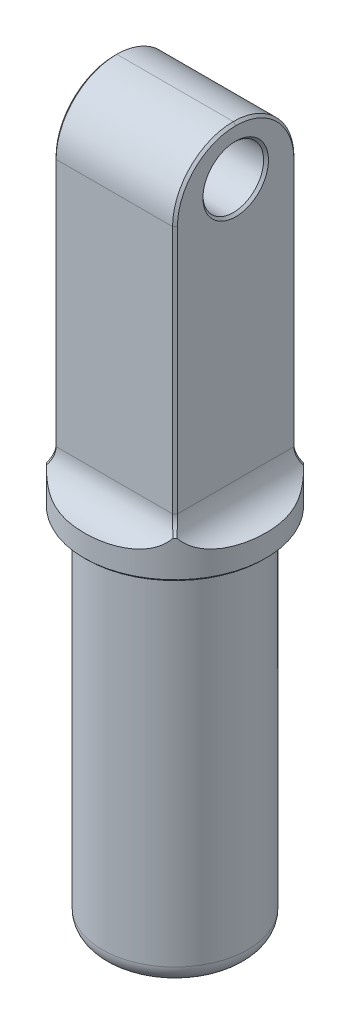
ISO-10303-21;
HEADER;
FILE_DESCRIPTION(('STEP AP214'),'2;1');
FILE_NAME('part.step','',(''),(''),'','','');
FILE_SCHEMA(('AUTOMOTIVE_DESIGN { 1 0 10303 214 1 1 1 1 }'));
ENDSEC;
DATA;
#1=APPLICATION_CONTEXT('core data for automotive mechanical design processes');
#2=APPLICATION_PROTOCOL_DEFINITION('international standard','automotive_design',2000,#1);
#3=PRODUCT_CONTEXT('',#1,'mechanical');
#4=PRODUCT('Part','Part','',(#3));
#5=PRODUCT_RELATED_PRODUCT_CATEGORY('part','',(#4));
#6=PRODUCT_DEFINITION_FORMATION('','',#4);
#7=PRODUCT_DEFINITION_CONTEXT('part definition',#1,'design');
#8=PRODUCT_DEFINITION('design','',#6,#7);
#9=PRODUCT_DEFINITION_SHAPE('','',#8);
#10=(LENGTH_UNIT() NAMED_UNIT(*) SI_UNIT(.MILLI.,.METRE.));
#11=(NAMED_UNIT(*) PLANE_ANGLE_UNIT() SI_UNIT($,.RADIAN.));
#12=(NAMED_UNIT(*) SI_UNIT($,.STERADIAN.) SOLID_ANGLE_UNIT());
#13=UNCERTAINTY_MEASURE_WITH_UNIT(LENGTH_MEASURE(1.E-05),#10,'distance_accuracy_value','');
#14=(GEOMETRIC_REPRESENTATION_CONTEXT(3) GLOBAL_UNCERTAINTY_ASSIGNED_CONTEXT((#13)) GLOBAL_UNIT_ASSIGNED_CONTEXT((#10,
#11,#12)) REPRESENTATION_CONTEXT('',''));
#15=CARTESIAN_POINT('',(0.,0.,0.));
#16=DIRECTION('',(0.,0.,1.));
#17=DIRECTION('',(1.,0.,0.));
#18=AXIS2_PLACEMENT_3D('',#15,#16,#17);
#19=CARTESIAN_POINT('',(0.,-5.,0.));
#20=DIRECTION('',(0.,1.,0.));
#21=DIRECTION('',(0.,0.,1.));
#22=AXIS2_PLACEMENT_3D('',#19,#20,#21);
#23=CYLINDRICAL_SURFACE('',#22,7.5);
#24=CARTESIAN_POINT('',(0.,-4.8,0.));
#25=DIRECTION('',(0.,-1.,0.));
#26=DIRECTION('',(0.,0.,-1.));
#27=AXIS2_PLACEMENT_3D('',#24,#25,#26);
#28=CIRCLE('',#27,7.5);
#29=CARTESIAN_POINT('',(0.,-4.8,-7.5));
#30=VERTEX_POINT('',#29);
#31=EDGE_CURVE('E463',#30,#30,#28,.F.);
#32=ORIENTED_EDGE('',*,*,#31,.T.);
#33=EDGE_LOOP('',(#32));
#34=FACE_BOUND('',#33,.T.);
#35=CARTESIAN_POINT('',(0.,-3.,-7.5));
#36=CARTESIAN_POINT('',(0.104849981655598,-2.99998778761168,-7.50000124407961));
#37=CARTESIAN_POINT('',(0.209699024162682,-2.99999968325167,-7.49780129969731));
#38=CARTESIAN_POINT('',(0.41921367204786,-2.9999829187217,-7.48900852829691));
#39=CARTESIAN_POINT('',(0.52387927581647,-2.99995425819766,-7.48241566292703));
#40=CARTESIAN_POINT('',(0.732933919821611,-2.99976752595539,-7.46483895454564));
#41=CARTESIAN_POINT('',(0.837322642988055,-2.99960934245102,-7.45385132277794));
#42=CARTESIAN_POINT('',(1.04553885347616,-2.99898288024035,-7.42750723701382));
#43=CARTESIAN_POINT('',(1.1493663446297,-2.99851460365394,-7.41215081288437));
#44=CARTESIAN_POINT('',(1.46143296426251,-2.99629303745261,-7.35927690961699));
#45=CARTESIAN_POINT('',(1.66857850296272,-2.99371755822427,-7.31509549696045));
#46=CARTESIAN_POINT('',(2.07817662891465,-2.98362345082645,-7.20942948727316));
#47=CARTESIAN_POINT('',(2.28063201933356,-2.97610785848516,-7.14795553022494));
#48=CARTESIAN_POINT('',(2.60779765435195,-2.95647523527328,-7.03333327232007));
#49=CARTESIAN_POINT('',(2.7343940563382,-2.94696861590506,-6.9850826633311));
#50=CARTESIAN_POINT('',(2.98440894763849,-2.92298435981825,-6.88197514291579));
#51=CARTESIAN_POINT('',(3.10782743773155,-2.90850672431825,-6.82711823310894));
#52=CARTESIAN_POINT('',(3.35048343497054,-2.87311806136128,-6.71135364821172));
#53=CARTESIAN_POINT('',(3.4697309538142,-2.85222381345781,-6.65046203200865));
#54=CARTESIAN_POINT('',(3.70344371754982,-2.80229189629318,-6.52320735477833));
#55=CARTESIAN_POINT('',(3.81791077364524,-2.7732573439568,-6.45684639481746));
#56=CARTESIAN_POINT('',(4.08017519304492,-2.69314635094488,-6.29549629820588));
#57=CARTESIAN_POINT('',(4.22563723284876,-2.63791277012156,-6.19860841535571));
#58=CARTESIAN_POINT('',(4.4327954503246,-2.53770385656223,-6.05041907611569));
#59=CARTESIAN_POINT('',(4.49989242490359,-2.50149263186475,-6.00064326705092));
#60=CARTESIAN_POINT('',(4.63003600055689,-2.42265829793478,-5.90080231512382));
#61=CARTESIAN_POINT('',(4.69308254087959,-2.38003509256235,-5.85073716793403));
#62=CARTESIAN_POINT('',(4.80817583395,-2.29265929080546,-5.75642242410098));
#63=CARTESIAN_POINT('',(4.86068509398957,-2.24858685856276,-5.71210855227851));
#64=CARTESIAN_POINT('',(4.96142123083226,-2.1546465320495,-5.62483227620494));
#65=CARTESIAN_POINT('',(5.00965064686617,-2.10478211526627,-5.58186908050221));
#66=CARTESIAN_POINT('',(5.10201665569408,-1.99832579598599,-5.49757968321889));
#67=CARTESIAN_POINT('',(5.14608324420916,-1.94164633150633,-5.45628652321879));
#68=CARTESIAN_POINT('',(5.22887487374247,-1.82214737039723,-5.37700680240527));
#69=CARTESIAN_POINT('',(5.26758748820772,-1.75931414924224,-5.33902800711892));
#70=CARTESIAN_POINT('',(5.30330085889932,-1.69352959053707,-5.30330085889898));
#71=B_SPLINE_CURVE_WITH_KNOTS('',3,(#35,#36,#37,#38,#39,#40,#41,#42,#43,#44,#45,#46,#47,#48,#49,
#50,#51,#52,#53,#54,#55,#56,#57,#58,#59,#60,#61,#62,#63,#64,#65,#66,#67,#68,#69,#70),
.UNSPECIFIED.,.F.,.F.,(4,2,2,2,2,2,2,2,2,2,2,2,2,2,2,2,2,4),(0.,0.314525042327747,
0.629052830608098,0.943852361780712,1.2586497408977,1.89327907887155,2.52751878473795,
2.93470905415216,3.34189922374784,3.74803352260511,4.15401252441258,4.70189932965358,
4.97481163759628,5.24772803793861,5.49231839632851,5.73676265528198,5.98477439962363,
6.2333524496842),.UNSPECIFIED.);
#72=CARTESIAN_POINT('',(0.,-3.,-7.5));
#73=VERTEX_POINT('',#72);
#74=CARTESIAN_POINT('',(5.21811297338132,-1.83634962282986,-5.38714182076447));
#75=VERTEX_POINT('',#74);
#76=EDGE_CURVE('E186',#73,#75,#71,.T.);
#77=ORIENTED_EDGE('',*,*,#76,.T.);
#78=CARTESIAN_POINT('',(5.38714172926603,-1.83634976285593,-5.2181130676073));
#79=CARTESIAN_POINT('',(5.38020876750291,-1.83652048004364,-5.22527061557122));
#80=CARTESIAN_POINT('',(5.37326133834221,-1.8366698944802,-5.23241465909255));
#81=CARTESIAN_POINT('',(5.35934083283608,-1.83692600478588,-5.24667223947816));
#82=CARTESIAN_POINT('',(5.35236776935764,-1.83703271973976,-5.25378578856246));
#83=CARTESIAN_POINT('',(5.33839516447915,-1.83720344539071,-5.26798316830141));
#84=CARTESIAN_POINT('',(5.33139563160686,-1.83726746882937,-5.27506700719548));
#85=CARTESIAN_POINT('',(5.31736927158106,-1.83735282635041,-5.28920576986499));
#86=CARTESIAN_POINT('',(5.31034244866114,-1.83737416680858,-5.29626069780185));
#87=CARTESIAN_POINT('',(5.29626069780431,-1.83737416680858,-5.31034244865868));
#88=CARTESIAN_POINT('',(5.2892057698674,-1.83735282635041,-5.31736927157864));
#89=CARTESIAN_POINT('',(5.27506700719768,-1.83726746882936,-5.33139563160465));
#90=CARTESIAN_POINT('',(5.26798316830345,-1.8372034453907,-5.3383951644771));
#91=CARTESIAN_POINT('',(5.25378578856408,-1.83703271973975,-5.35236776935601));
#92=CARTESIAN_POINT('',(5.24667223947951,-1.83692600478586,-5.35934083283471));
#93=CARTESIAN_POINT('',(5.23241465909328,-1.83666989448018,-5.37326133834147));
#94=CARTESIAN_POINT('',(5.22527061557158,-1.83652048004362,-5.38020876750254));
#95=CARTESIAN_POINT('',(5.21811306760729,-1.83634976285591,-5.38714172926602));
#96=B_SPLINE_CURVE_WITH_KNOTS('',3,(#78,#79,#80,#81,#82,#83,#84,#85,#86,#87,#88,#89,#90,#91,#92,
#93,#94,#95),.UNSPECIFIED.,.F.,.F.,(4,2,2,2,2,2,2,2,4),(0.,0.0298986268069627,
0.0597838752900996,0.0896602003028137,0.119532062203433,0.149403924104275,0.179280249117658,
0.209165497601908,0.239064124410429),.UNSPECIFIED.);
#97=CARTESIAN_POINT('',(5.38714172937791,-1.83634947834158,-5.21811306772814));
#98=VERTEX_POINT('',#97);
#99=EDGE_CURVE('E335',#75,#98,#96,.F.);
#100=ORIENTED_EDGE('',*,*,#99,.T.);
#101=CARTESIAN_POINT('',(5.30330085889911,-1.69352959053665,-5.30330085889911));
#102=CARTESIAN_POINT('',(5.33566708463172,-1.75311022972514,-5.27093694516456));
#103=CARTESIAN_POINT('',(5.36986596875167,-1.81026552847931,-5.23614154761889));
#104=CARTESIAN_POINT('',(5.44108434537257,-1.91954449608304,-5.1620964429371));
#105=CARTESIAN_POINT('',(5.4780986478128,-1.9716770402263,-5.1228548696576));
#106=CARTESIAN_POINT('',(5.5912824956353,-2.11926647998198,-4.99997551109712));
#107=CARTESIAN_POINT('',(5.67048898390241,-2.20748970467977,-4.91030943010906));
#108=CARTESIAN_POINT('',(5.80212750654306,-2.33640760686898,-4.75307818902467));
#109=CARTESIAN_POINT('',(5.85383679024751,-2.38272741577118,-4.68931248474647));
#110=CARTESIAN_POINT('',(5.95726115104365,-2.46836381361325,-4.55719850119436));
#111=CARTESIAN_POINT('',(6.00897622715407,-2.50767896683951,-4.48884928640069));
#112=CARTESIAN_POINT('',(6.11173464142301,-2.58007031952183,-4.34791303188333));
#113=CARTESIAN_POINT('',(6.16277377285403,-2.61311685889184,-4.2753078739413));
#114=CARTESIAN_POINT('',(6.26327085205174,-2.67346146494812,-4.12668087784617));
#115=CARTESIAN_POINT('',(6.3127282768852,-2.70075764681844,-4.05065792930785));
#116=CARTESIAN_POINT('',(6.43554987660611,-2.76361369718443,-3.85401126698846));
#117=CARTESIAN_POINT('',(6.50747372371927,-2.79572807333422,-3.73138023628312));
#118=CARTESIAN_POINT('',(6.645006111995,-2.85041756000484,-3.48057332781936));
#119=CARTESIAN_POINT('',(6.71061128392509,-2.8729876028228,-3.35239454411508));
#120=CARTESIAN_POINT('',(6.83487659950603,-2.91077603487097,-3.09118817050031));
#121=CARTESIAN_POINT('',(6.89351439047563,-2.92597122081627,-2.9581466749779));
#122=CARTESIAN_POINT('',(7.00309604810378,-2.95076246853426,-2.68846454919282));
#123=CARTESIAN_POINT('',(7.05404037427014,-2.96035886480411,-2.55182413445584));
#124=CARTESIAN_POINT('',(7.167114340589,-2.9786481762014,-2.21916120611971));
#125=CARTESIAN_POINT('',(7.22530992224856,-2.98537005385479,-2.02168614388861));
#126=CARTESIAN_POINT('',(7.32530250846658,-2.9943940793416,-1.62244309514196));
#127=CARTESIAN_POINT('',(7.36709157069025,-2.99669408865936,-1.42067307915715));
#128=CARTESIAN_POINT('',(7.41706063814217,-2.99867601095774,-1.1169668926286));
#129=CARTESIAN_POINT('',(7.43155881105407,-2.99909340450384,-1.01603654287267));
#130=CARTESIAN_POINT('',(7.45642983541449,-2.9996517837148,-0.813661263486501));
#131=CARTESIAN_POINT('',(7.46680266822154,-2.99979276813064,-0.712216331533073));
#132=CARTESIAN_POINT('',(7.48339743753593,-2.99995922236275,-0.509060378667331));
#133=CARTESIAN_POINT('',(7.48962226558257,-2.99998477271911,-0.407349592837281));
#134=CARTESIAN_POINT('',(7.49792408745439,-2.99999971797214,-0.203759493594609));
#135=CARTESIAN_POINT('',(7.50000110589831,-2.9999891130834,-0.101880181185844));
#136=CARTESIAN_POINT('',(7.5,-3.00000000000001,0.));
#137=B_SPLINE_CURVE_WITH_KNOTS('',3,(#101,#102,#103,#104,#105,#106,#107,#108,#109,#110,#111,
#112,#113,#114,#115,#116,#117,#118,#119,#120,#121,#122,#123,#124,#125,#126,#127,#128,#129,#130,
#131,#132,#133,#134,#135,#136),.UNSPECIFIED.,.F.,.F.,(4,2,2,2,2,2,2,2,2,2,2,2,2,2,2,2,2,4),(0.,
0.225151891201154,0.449898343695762,0.893450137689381,1.17592167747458,1.45845104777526,
1.74228557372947,2.02621298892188,2.46276736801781,2.89955325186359,3.33770461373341,
3.77582979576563,4.39295883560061,5.01038625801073,5.31621778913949,5.62205070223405,
5.92767019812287,6.23328788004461),.UNSPECIFIED.);
#138=CARTESIAN_POINT('',(7.5,-3.,0.));
#139=VERTEX_POINT('',#138);
#140=EDGE_CURVE('E192',#98,#139,#137,.T.);
#141=ORIENTED_EDGE('',*,*,#140,.T.);
#142=CARTESIAN_POINT('',(7.5,-3.,0.));
#143=CARTESIAN_POINT('',(7.50000124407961,-2.99998778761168,0.104849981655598));
#144=CARTESIAN_POINT('',(7.49780129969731,-2.99999968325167,0.209699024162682));
#145=CARTESIAN_POINT('',(7.48900852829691,-2.9999829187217,0.41921367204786));
#146=CARTESIAN_POINT('',(7.48241566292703,-2.99995425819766,0.52387927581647));
#147=CARTESIAN_POINT('',(7.46483895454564,-2.99976752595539,0.732933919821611));
#148=CARTESIAN_POINT('',(7.45385132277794,-2.99960934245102,0.837322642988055));
#149=CARTESIAN_POINT('',(7.42750723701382,-2.99898288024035,1.04553885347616));
#150=CARTESIAN_POINT('',(7.41215081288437,-2.99851460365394,1.1493663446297));
#151=CARTESIAN_POINT('',(7.35927690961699,-2.99629303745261,1.46143296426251));
#152=CARTESIAN_POINT('',(7.31509549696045,-2.99371755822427,1.66857850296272));
#153=CARTESIAN_POINT('',(7.20942948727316,-2.98362345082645,2.07817662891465));
#154=CARTESIAN_POINT('',(7.14795553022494,-2.97610785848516,2.28063201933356));
#155=CARTESIAN_POINT('',(7.03333327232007,-2.95647523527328,2.60779765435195));
#156=CARTESIAN_POINT('',(6.9850826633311,-2.94696861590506,2.7343940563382));
#157=CARTESIAN_POINT('',(6.88197514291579,-2.92298435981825,2.98440894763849));
#158=CARTESIAN_POINT('',(6.82711823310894,-2.90850672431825,3.10782743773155));
#159=CARTESIAN_POINT('',(6.71135364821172,-2.87311806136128,3.35048343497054));
#160=CARTESIAN_POINT('',(6.65046203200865,-2.85222381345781,3.4697309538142));
#161=CARTESIAN_POINT('',(6.52320735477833,-2.80229189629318,3.70344371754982));
#162=CARTESIAN_POINT('',(6.45684639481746,-2.7732573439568,3.81791077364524));
#163=CARTESIAN_POINT('',(6.29549629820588,-2.69314635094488,4.08017519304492));
#164=CARTESIAN_POINT('',(6.19860841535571,-2.63791277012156,4.22563723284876));
#165=CARTESIAN_POINT('',(6.05041907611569,-2.53770385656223,4.4327954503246));
#166=CARTESIAN_POINT('',(6.00064326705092,-2.50149263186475,4.49989242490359));
#167=CARTESIAN_POINT('',(5.90080231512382,-2.42265829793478,4.63003600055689));
#168=CARTESIAN_POINT('',(5.85073716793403,-2.38003509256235,4.69308254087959));
#169=CARTESIAN_POINT('',(5.75642242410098,-2.29265929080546,4.80817583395));
#170=CARTESIAN_POINT('',(5.71210855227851,-2.24858685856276,4.86068509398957));
#171=CARTESIAN_POINT('',(5.62483227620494,-2.1546465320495,4.96142123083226));
#172=CARTESIAN_POINT('',(5.58186908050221,-2.10478211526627,5.00965064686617));
#173=CARTESIAN_POINT('',(5.49757968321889,-1.99832579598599,5.10201665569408));
#174=CARTESIAN_POINT('',(5.45628652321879,-1.94164633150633,5.14608324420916));
#175=CARTESIAN_POINT('',(5.37700680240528,-1.82214737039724,5.22887487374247));
#176=CARTESIAN_POINT('',(5.33902800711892,-1.75931414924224,5.26758748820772));
#177=CARTESIAN_POINT('',(5.30330085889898,-1.69352959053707,5.30330085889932));
#178=B_SPLINE_CURVE_WITH_KNOTS('',3,(#142,#143,#144,#145,#146,#147,#148,#149,#150,#151,#152,
#153,#154,#155,#156,#157,#158,#159,#160,#161,#162,#163,#164,#165,#166,#167,#168,#169,#170,#171,
#172,#173,#174,#175,#176,#177),.UNSPECIFIED.,.F.,.F.,(4,2,2,2,2,2,2,2,2,2,2,2,2,2,2,2,2,4),(0.,
0.314525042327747,0.629052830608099,0.943852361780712,1.2586497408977,1.89327907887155,
2.52751878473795,2.93470905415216,3.34189922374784,3.74803352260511,4.15401252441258,
4.70189932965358,4.97481163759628,5.24772803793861,5.49231839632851,5.73676265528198,
5.98477439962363,6.23335244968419),.UNSPECIFIED.);
#179=CARTESIAN_POINT('',(5.38714182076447,-1.83634962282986,5.21811297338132));
#180=VERTEX_POINT('',#179);
#181=EDGE_CURVE('E421',#139,#180,#178,.T.);
#182=ORIENTED_EDGE('',*,*,#181,.T.);
#183=CARTESIAN_POINT('',(5.2181130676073,-1.83634976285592,5.38714172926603));
#184=CARTESIAN_POINT('',(5.22527061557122,-1.83652048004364,5.38020876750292));
#185=CARTESIAN_POINT('',(5.23241465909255,-1.83666989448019,5.37326133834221));
#186=CARTESIAN_POINT('',(5.24667223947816,-1.83692600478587,5.35934083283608));
#187=CARTESIAN_POINT('',(5.25378578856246,-1.83703271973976,5.35236776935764));
#188=CARTESIAN_POINT('',(5.26798316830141,-1.83720344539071,5.33839516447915));
#189=CARTESIAN_POINT('',(5.27506700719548,-1.83726746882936,5.33139563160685));
#190=CARTESIAN_POINT('',(5.28920576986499,-1.83735282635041,5.31736927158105));
#191=CARTESIAN_POINT('',(5.29626069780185,-1.83737416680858,5.31034244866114));
#192=CARTESIAN_POINT('',(5.31034244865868,-1.83737416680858,5.29626069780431));
#193=CARTESIAN_POINT('',(5.31736927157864,-1.83735282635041,5.2892057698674));
#194=CARTESIAN_POINT('',(5.33139563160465,-1.83726746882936,5.27506700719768));
#195=CARTESIAN_POINT('',(5.3383951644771,-1.8372034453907,5.26798316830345));
#196=CARTESIAN_POINT('',(5.35236776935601,-1.83703271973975,5.25378578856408));
#197=CARTESIAN_POINT('',(5.35934083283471,-1.83692600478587,5.24667223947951));
#198=CARTESIAN_POINT('',(5.37326133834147,-1.83666989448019,5.23241465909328));
#199=CARTESIAN_POINT('',(5.38020876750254,-1.83652048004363,5.22527061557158));
#200=CARTESIAN_POINT('',(5.38714172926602,-1.83634976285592,5.21811306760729));
#201=B_SPLINE_CURVE_WITH_KNOTS('',3,(#183,#184,#185,#186,#187,#188,#189,#190,#191,#192,#193,
#194,#195,#196,#197,#198,#199,#200),.UNSPECIFIED.,.F.,.F.,(4,2,2,2,2,2,2,2,4),(0.,
0.0298986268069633,0.0597838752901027,0.0896602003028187,0.119532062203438,0.149403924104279,
0.17928024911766,0.209165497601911,0.239064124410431),.UNSPECIFIED.);
#202=CARTESIAN_POINT('',(5.21811297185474,-1.83634962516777,5.38714182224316));
#203=VERTEX_POINT('',#202);
#204=EDGE_CURVE('E342',#180,#203,#201,.F.);
#205=ORIENTED_EDGE('',*,*,#204,.T.);
#206=CARTESIAN_POINT('',(5.30330085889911,-1.69352959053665,5.30330085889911));
#207=CARTESIAN_POINT('',(5.27093694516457,-1.75311022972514,5.33566708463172));
#208=CARTESIAN_POINT('',(5.23614154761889,-1.81026552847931,5.36986596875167));
#209=CARTESIAN_POINT('',(5.1620964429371,-1.91954449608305,5.44108434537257));
#210=CARTESIAN_POINT('',(5.1228548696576,-1.97167704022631,5.4780986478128));
#211=CARTESIAN_POINT('',(4.99997551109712,-2.11926647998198,5.5912824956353));
#212=CARTESIAN_POINT('',(4.91030943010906,-2.20748970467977,5.67048898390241));
#213=CARTESIAN_POINT('',(4.75307818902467,-2.33640760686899,5.80212750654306));
#214=CARTESIAN_POINT('',(4.68931248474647,-2.38272741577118,5.85383679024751));
#215=CARTESIAN_POINT('',(4.55719850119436,-2.46836381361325,5.95726115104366));
#216=CARTESIAN_POINT('',(4.48884928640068,-2.50767896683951,6.00897622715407));
#217=CARTESIAN_POINT('',(4.34791303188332,-2.58007031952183,6.11173464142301));
#218=CARTESIAN_POINT('',(4.27530787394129,-2.61311685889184,6.16277377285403));
#219=CARTESIAN_POINT('',(4.12668087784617,-2.67346146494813,6.26327085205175));
#220=CARTESIAN_POINT('',(4.05065792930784,-2.70075764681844,6.31272827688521));
#221=CARTESIAN_POINT('',(3.85401126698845,-2.76361369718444,6.43554987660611));
#222=CARTESIAN_POINT('',(3.73138023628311,-2.79572807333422,6.50747372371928));
#223=CARTESIAN_POINT('',(3.48057332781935,-2.85041756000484,6.64500611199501));
#224=CARTESIAN_POINT('',(3.35239454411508,-2.8729876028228,6.71061128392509));
#225=CARTESIAN_POINT('',(3.0911881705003,-2.91077603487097,6.83487659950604));
#226=CARTESIAN_POINT('',(2.95814667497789,-2.92597122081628,6.89351439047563));
#227=CARTESIAN_POINT('',(2.68846454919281,-2.95076246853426,7.00309604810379));
#228=CARTESIAN_POINT('',(2.55182413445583,-2.96035886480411,7.05404037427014));
#229=CARTESIAN_POINT('',(2.2191612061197,-2.97864817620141,7.167114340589));
#230=CARTESIAN_POINT('',(2.0216861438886,-2.98537005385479,7.22530992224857));
#231=CARTESIAN_POINT('',(1.62244309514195,-2.9943940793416,7.32530250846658));
#232=CARTESIAN_POINT('',(1.42067307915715,-2.99669408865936,7.36709157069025));
#233=CARTESIAN_POINT('',(1.11696689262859,-2.99867601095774,7.41706063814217));
#234=CARTESIAN_POINT('',(1.01603654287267,-2.99909340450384,7.43155881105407));
#235=CARTESIAN_POINT('',(0.813661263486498,-2.9996517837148,7.45642983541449));
#236=CARTESIAN_POINT('',(0.71221633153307,-2.99979276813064,7.46680266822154));
#237=CARTESIAN_POINT('',(0.509060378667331,-2.99995922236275,7.48339743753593));
#238=CARTESIAN_POINT('',(0.407349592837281,-2.99998477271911,7.48962226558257));
#239=CARTESIAN_POINT('',(0.20375949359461,-2.99999971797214,7.49792408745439));
#240=CARTESIAN_POINT('',(0.101880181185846,-2.9999891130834,7.5000011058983));
#241=CARTESIAN_POINT('',(0.,-3.00000000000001,7.5));
#242=B_SPLINE_CURVE_WITH_KNOTS('',3,(#206,#207,#208,#209,#210,#211,#212,#213,#214,#215,#216,
#217,#218,#219,#220,#221,#222,#223,#224,#225,#226,#227,#228,#229,#230,#231,#232,#233,#234,#235,
#236,#237,#238,#239,#240,#241),.UNSPECIFIED.,.F.,.F.,(4,2,2,2,2,2,2,2,2,2,2,2,2,2,2,2,2,4),(0.,
0.225151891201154,0.449898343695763,0.893450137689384,1.17592167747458,1.45845104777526,
1.74228557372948,2.02621298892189,2.46276736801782,2.8995532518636,3.33770461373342,
3.77582979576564,4.39295883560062,5.01038625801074,5.3162177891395,5.62205070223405,
5.92767019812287,6.23328788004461),.UNSPECIFIED.);
#243=CARTESIAN_POINT('',(0.,-3.,7.5));
#244=VERTEX_POINT('',#243);
#245=EDGE_CURVE('E412',#203,#244,#242,.T.);
#246=ORIENTED_EDGE('',*,*,#245,.T.);
#247=CARTESIAN_POINT('',(0.,-3.,7.5));
#248=CARTESIAN_POINT('',(-0.104849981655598,-2.99998778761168,7.50000124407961));
#249=CARTESIAN_POINT('',(-0.209699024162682,-2.99999968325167,7.49780129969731));
#250=CARTESIAN_POINT('',(-0.419213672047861,-2.9999829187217,7.48900852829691));
#251=CARTESIAN_POINT('',(-0.52387927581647,-2.99995425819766,7.48241566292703));
#252=CARTESIAN_POINT('',(-0.732933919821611,-2.99976752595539,7.46483895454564));
#253=CARTESIAN_POINT('',(-0.837322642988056,-2.99960934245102,7.45385132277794));
#254=CARTESIAN_POINT('',(-1.04553885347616,-2.99898288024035,7.42750723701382));
#255=CARTESIAN_POINT('',(-1.1493663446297,-2.99851460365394,7.41215081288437));
#256=CARTESIAN_POINT('',(-1.46143296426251,-2.99629303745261,7.35927690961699));
#257=CARTESIAN_POINT('',(-1.66857850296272,-2.99371755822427,7.31509549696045));
#258=CARTESIAN_POINT('',(-2.07817662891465,-2.98362345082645,7.20942948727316));
#259=CARTESIAN_POINT('',(-2.28063201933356,-2.97610785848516,7.14795553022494));
#260=CARTESIAN_POINT('',(-2.60779765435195,-2.95647523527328,7.03333327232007));
#261=CARTESIAN_POINT('',(-2.7343940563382,-2.94696861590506,6.9850826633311));
#262=CARTESIAN_POINT('',(-2.98440894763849,-2.92298435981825,6.88197514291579));
#263=CARTESIAN_POINT('',(-3.10782743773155,-2.90850672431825,6.82711823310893));
#264=CARTESIAN_POINT('',(-3.35048343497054,-2.87311806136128,6.71135364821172));
#265=CARTESIAN_POINT('',(-3.46973095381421,-2.85222381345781,6.65046203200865));
#266=CARTESIAN_POINT('',(-3.70344371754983,-2.80229189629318,6.52320735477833));
#267=CARTESIAN_POINT('',(-3.81791077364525,-2.7732573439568,6.45684639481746));
#268=CARTESIAN_POINT('',(-4.08017519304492,-2.69314635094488,6.29549629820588));
#269=CARTESIAN_POINT('',(-4.22563723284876,-2.63791277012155,6.19860841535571));
#270=CARTESIAN_POINT('',(-4.4327954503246,-2.53770385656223,6.05041907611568));
#271=CARTESIAN_POINT('',(-4.4998924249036,-2.50149263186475,6.00064326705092));
#272=CARTESIAN_POINT('',(-4.6300360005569,-2.42265829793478,5.90080231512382));
#273=CARTESIAN_POINT('',(-4.69308254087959,-2.38003509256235,5.85073716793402));
#274=CARTESIAN_POINT('',(-4.80817583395,-2.29265929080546,5.75642242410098));
#275=CARTESIAN_POINT('',(-4.86068509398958,-2.24858685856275,5.7121085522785));
#276=CARTESIAN_POINT('',(-4.96142123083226,-2.1546465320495,5.62483227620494));
#277=CARTESIAN_POINT('',(-5.00965064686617,-2.10478211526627,5.5818690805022));
#278=CARTESIAN_POINT('',(-5.10201665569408,-1.99832579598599,5.49757968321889));
#279=CARTESIAN_POINT('',(-5.14608324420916,-1.94164633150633,5.45628652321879));
#280=CARTESIAN_POINT('',(-5.22887487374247,-1.82214737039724,5.37700680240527));
#281=CARTESIAN_POINT('',(-5.26758748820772,-1.75931414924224,5.33902800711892));
#282=CARTESIAN_POINT('',(-5.30330085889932,-1.69352959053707,5.30330085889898));
#283=B_SPLINE_CURVE_WITH_KNOTS('',3,(#247,#248,#249,#250,#251,#252,#253,#254,#255,#256,#257,
#258,#259,#260,#261,#262,#263,#264,#265,#266,#267,#268,#269,#270,#271,#272,#273,#274,#275,#276,
#277,#278,#279,#280,#281,#282),.UNSPECIFIED.,.F.,.F.,(4,2,2,2,2,2,2,2,2,2,2,2,2,2,2,2,2,4),(0.,
0.314525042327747,0.629052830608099,0.943852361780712,1.2586497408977,1.89327907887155,
2.52751878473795,2.93470905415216,3.34189922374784,3.74803352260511,4.15401252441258,
4.70189932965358,4.97481163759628,5.24772803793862,5.49231839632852,5.73676265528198,
5.98477439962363,6.2333524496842),.UNSPECIFIED.);
#284=CARTESIAN_POINT('',(-5.21811297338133,-1.83634962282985,5.38714182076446));
#285=VERTEX_POINT('',#284);
#286=EDGE_CURVE('E420',#244,#285,#283,.T.);
#287=ORIENTED_EDGE('',*,*,#286,.T.);
#288=CARTESIAN_POINT('',(-5.38714172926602,-1.83634976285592,5.2181130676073));
#289=CARTESIAN_POINT('',(-5.38020876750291,-1.83652048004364,5.22527061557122));
#290=CARTESIAN_POINT('',(-5.3732613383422,-1.83666989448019,5.23241465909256));
#291=CARTESIAN_POINT('',(-5.35934083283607,-1.83692600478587,5.24667223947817));
#292=CARTESIAN_POINT('',(-5.35236776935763,-1.83703271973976,5.25378578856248));
#293=CARTESIAN_POINT('',(-5.33839516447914,-1.8372034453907,5.26798316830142));
#294=CARTESIAN_POINT('',(-5.33139563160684,-1.83726746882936,5.2750670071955));
#295=CARTESIAN_POINT('',(-5.31736927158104,-1.83735282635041,5.289205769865));
#296=CARTESIAN_POINT('',(-5.31034244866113,-1.83737416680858,5.29626069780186));
#297=CARTESIAN_POINT('',(-5.2962606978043,-1.83737416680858,5.31034244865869));
#298=CARTESIAN_POINT('',(-5.28920576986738,-1.83735282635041,5.31736927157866));
#299=CARTESIAN_POINT('',(-5.27506700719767,-1.83726746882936,5.33139563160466));
#300=CARTESIAN_POINT('',(-5.26798316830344,-1.8372034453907,5.33839516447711));
#301=CARTESIAN_POINT('',(-5.25378578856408,-1.83703271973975,5.35236776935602));
#302=CARTESIAN_POINT('',(-5.24667223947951,-1.83692600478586,5.35934083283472));
#303=CARTESIAN_POINT('',(-5.23241465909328,-1.83666989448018,5.37326133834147));
#304=CARTESIAN_POINT('',(-5.22527061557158,-1.83652048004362,5.38020876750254));
#305=CARTESIAN_POINT('',(-5.21811306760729,-1.83634976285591,5.38714172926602));
#306=B_SPLINE_CURVE_WITH_KNOTS('',3,(#288,#289,#290,#291,#292,#293,#294,#295,#296,#297,#298,
#299,#300,#301,#302,#303,#304,#305),.UNSPECIFIED.,.F.,.F.,(4,2,2,2,2,2,2,2,4),(0.,
0.0298986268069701,0.0597838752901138,0.0896602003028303,0.11953206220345,0.149403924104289,
0.179280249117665,0.209165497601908,0.239064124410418),.UNSPECIFIED.);
#307=CARTESIAN_POINT('',(-5.38714182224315,-1.83634962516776,5.21811297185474));
#308=VERTEX_POINT('',#307);
#309=EDGE_CURVE('E171',#285,#308,#306,.F.);
#310=ORIENTED_EDGE('',*,*,#309,.T.);
#311=CARTESIAN_POINT('',(-5.30330085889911,-1.69352959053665,5.30330085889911));
#312=CARTESIAN_POINT('',(-5.33566708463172,-1.75311022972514,5.27093694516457));
#313=CARTESIAN_POINT('',(-5.36986596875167,-1.81026552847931,5.23614154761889));
#314=CARTESIAN_POINT('',(-5.44108434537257,-1.91954449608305,5.1620964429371));
#315=CARTESIAN_POINT('',(-5.4780986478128,-1.97167704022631,5.1228548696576));
#316=CARTESIAN_POINT('',(-5.5912824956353,-2.11926647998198,4.99997551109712));
#317=CARTESIAN_POINT('',(-5.67048898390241,-2.20748970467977,4.91030943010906));
#318=CARTESIAN_POINT('',(-5.80212750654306,-2.33640760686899,4.75307818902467));
#319=CARTESIAN_POINT('',(-5.85383679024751,-2.38272741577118,4.68931248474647));
#320=CARTESIAN_POINT('',(-5.95726115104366,-2.46836381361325,4.55719850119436));
#321=CARTESIAN_POINT('',(-6.00897622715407,-2.50767896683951,4.48884928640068));
#322=CARTESIAN_POINT('',(-6.11173464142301,-2.58007031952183,4.34791303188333));
#323=CARTESIAN_POINT('',(-6.16277377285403,-2.61311685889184,4.27530787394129));
#324=CARTESIAN_POINT('',(-6.26327085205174,-2.67346146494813,4.12668087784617));
#325=CARTESIAN_POINT('',(-6.31272827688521,-2.70075764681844,4.05065792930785));
#326=CARTESIAN_POINT('',(-6.43554987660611,-2.76361369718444,3.85401126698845));
#327=CARTESIAN_POINT('',(-6.50747372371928,-2.79572807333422,3.73138023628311));
#328=CARTESIAN_POINT('',(-6.64500611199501,-2.85041756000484,3.48057332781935));
#329=CARTESIAN_POINT('',(-6.71061128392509,-2.8729876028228,3.35239454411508));
#330=CARTESIAN_POINT('',(-6.83487659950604,-2.91077603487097,3.0911881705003));
#331=CARTESIAN_POINT('',(-6.89351439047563,-2.92597122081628,2.95814667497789));
#332=CARTESIAN_POINT('',(-7.00309604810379,-2.95076246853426,2.68846454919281));
#333=CARTESIAN_POINT('',(-7.05404037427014,-2.96035886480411,2.55182413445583));
#334=CARTESIAN_POINT('',(-7.167114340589,-2.97864817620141,2.2191612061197));
#335=CARTESIAN_POINT('',(-7.22530992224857,-2.98537005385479,2.0216861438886));
#336=CARTESIAN_POINT('',(-7.32530250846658,-2.9943940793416,1.62244309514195));
#337=CARTESIAN_POINT('',(-7.36709157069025,-2.99669408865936,1.42067307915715));
#338=CARTESIAN_POINT('',(-7.41706063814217,-2.99867601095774,1.11696689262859));
#339=CARTESIAN_POINT('',(-7.43155881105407,-2.99909340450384,1.01603654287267));
#340=CARTESIAN_POINT('',(-7.45642983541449,-2.9996517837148,0.813661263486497));
#341=CARTESIAN_POINT('',(-7.46680266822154,-2.99979276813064,0.71221633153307));
#342=CARTESIAN_POINT('',(-7.48339743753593,-2.99995922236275,0.50906037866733));
#343=CARTESIAN_POINT('',(-7.48962226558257,-2.99998477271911,0.40734959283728));
#344=CARTESIAN_POINT('',(-7.49792408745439,-2.99999971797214,0.203759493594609));
#345=CARTESIAN_POINT('',(-7.5000011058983,-2.9999891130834,0.101880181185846));
#346=CARTESIAN_POINT('',(-7.5,-3.00000000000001,0.));
#347=B_SPLINE_CURVE_WITH_KNOTS('',3,(#311,#312,#313,#314,#315,#316,#317,#318,#319,#320,#321,
#322,#323,#324,#325,#326,#327,#328,#329,#330,#331,#332,#333,#334,#335,#336,#337,#338,#339,#340,
#341,#342,#343,#344,#345,#346),.UNSPECIFIED.,.F.,.F.,(4,2,2,2,2,2,2,2,2,2,2,2,2,2,2,2,2,4),(0.,
0.225151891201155,0.449898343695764,0.893450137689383,1.17592167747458,1.45845104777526,
1.74228557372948,2.02621298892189,2.46276736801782,2.8995532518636,3.33770461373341,
3.77582979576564,4.39295883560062,5.01038625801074,5.3162177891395,5.62205070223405,
5.92767019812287,6.23328788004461),.UNSPECIFIED.);
#348=CARTESIAN_POINT('',(-7.5,-3.,0.));
#349=VERTEX_POINT('',#348);
#350=EDGE_CURVE('E164',#308,#349,#347,.T.);
#351=ORIENTED_EDGE('',*,*,#350,.T.);
#352=CARTESIAN_POINT('',(-7.5,-3.,0.));
#353=CARTESIAN_POINT('',(-7.50000124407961,-2.99998778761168,-0.104849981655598));
#354=CARTESIAN_POINT('',(-7.49780129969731,-2.99999968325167,-0.209699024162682));
#355=CARTESIAN_POINT('',(-7.48900852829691,-2.9999829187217,-0.41921367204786));
#356=CARTESIAN_POINT('',(-7.48241566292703,-2.99995425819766,-0.523879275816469));
#357=CARTESIAN_POINT('',(-7.46483895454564,-2.99976752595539,-0.732933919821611));
#358=CARTESIAN_POINT('',(-7.45385132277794,-2.99960934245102,-0.837322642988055));
#359=CARTESIAN_POINT('',(-7.42750723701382,-2.99898288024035,-1.04553885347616));
#360=CARTESIAN_POINT('',(-7.41215081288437,-2.99851460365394,-1.1493663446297));
#361=CARTESIAN_POINT('',(-7.35927690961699,-2.99629303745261,-1.46143296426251));
#362=CARTESIAN_POINT('',(-7.31509549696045,-2.99371755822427,-1.66857850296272));
#363=CARTESIAN_POINT('',(-7.20942948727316,-2.98362345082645,-2.07817662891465));
#364=CARTESIAN_POINT('',(-7.14795553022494,-2.97610785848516,-2.28063201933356));
#365=CARTESIAN_POINT('',(-7.03333327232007,-2.95647523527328,-2.60779765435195));
#366=CARTESIAN_POINT('',(-6.9850826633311,-2.94696861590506,-2.7343940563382));
#367=CARTESIAN_POINT('',(-6.88197514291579,-2.92298435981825,-2.98440894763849));
#368=CARTESIAN_POINT('',(-6.82711823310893,-2.90850672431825,-3.10782743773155));
#369=CARTESIAN_POINT('',(-6.71135364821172,-2.87311806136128,-3.35048343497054));
#370=CARTESIAN_POINT('',(-6.65046203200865,-2.85222381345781,-3.46973095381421));
#371=CARTESIAN_POINT('',(-6.52320735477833,-2.80229189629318,-3.70344371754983));
#372=CARTESIAN_POINT('',(-6.45684639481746,-2.7732573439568,-3.81791077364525));
#373=CARTESIAN_POINT('',(-6.29549629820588,-2.69314635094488,-4.08017519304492));
#374=CARTESIAN_POINT('',(-6.19860841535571,-2.63791277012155,-4.22563723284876));
#375=CARTESIAN_POINT('',(-6.05041907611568,-2.53770385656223,-4.4327954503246));
#376=CARTESIAN_POINT('',(-6.00064326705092,-2.50149263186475,-4.4998924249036));
#377=CARTESIAN_POINT('',(-5.90080231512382,-2.42265829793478,-4.6300360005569));
#378=CARTESIAN_POINT('',(-5.85073716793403,-2.38003509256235,-4.69308254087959));
#379=CARTESIAN_POINT('',(-5.75642242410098,-2.29265929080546,-4.80817583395));
#380=CARTESIAN_POINT('',(-5.7121085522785,-2.24858685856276,-4.86068509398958));
#381=CARTESIAN_POINT('',(-5.62483227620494,-2.1546465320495,-4.96142123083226));
#382=CARTESIAN_POINT('',(-5.5818690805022,-2.10478211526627,-5.00965064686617));
#383=CARTESIAN_POINT('',(-5.49757968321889,-1.99832579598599,-5.10201665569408));
#384=CARTESIAN_POINT('',(-5.45628652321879,-1.94164633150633,-5.14608324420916));
#385=CARTESIAN_POINT('',(-5.37700680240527,-1.82214737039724,-5.22887487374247));
#386=CARTESIAN_POINT('',(-5.33902800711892,-1.75931414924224,-5.26758748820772));
#387=CARTESIAN_POINT('',(-5.30330085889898,-1.69352959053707,-5.30330085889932));
#388=B_SPLINE_CURVE_WITH_KNOTS('',3,(#352,#353,#354,#355,#356,#357,#358,#359,#360,#361,#362,
#363,#364,#365,#366,#367,#368,#369,#370,#371,#372,#373,#374,#375,#376,#377,#378,#379,#380,#381,
#382,#383,#384,#385,#386,#387),.UNSPECIFIED.,.F.,.F.,(4,2,2,2,2,2,2,2,2,2,2,2,2,2,2,2,2,4),(0.,
0.314525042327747,0.629052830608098,0.943852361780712,1.2586497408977,1.89327907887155,
2.52751878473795,2.93470905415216,3.34189922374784,3.74803352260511,4.15401252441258,
4.70189932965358,4.97481163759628,5.24772803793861,5.49231839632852,5.73676265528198,
5.98477439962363,6.2333524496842),.UNSPECIFIED.);
#389=CARTESIAN_POINT('',(-5.38714182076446,-1.83634962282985,-5.21811297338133));
#390=VERTEX_POINT('',#389);
#391=EDGE_CURVE('E167',#349,#390,#388,.T.);
#392=ORIENTED_EDGE('',*,*,#391,.T.);
#393=CARTESIAN_POINT('',(-5.2181130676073,-1.83634976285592,-5.38714172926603));
#394=CARTESIAN_POINT('',(-5.22527061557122,-1.83652048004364,-5.38020876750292));
#395=CARTESIAN_POINT('',(-5.23241465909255,-1.83666989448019,-5.37326133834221));
#396=CARTESIAN_POINT('',(-5.24667223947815,-1.83692600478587,-5.35934083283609));
#397=CARTESIAN_POINT('',(-5.25378578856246,-1.83703271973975,-5.35236776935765));
#398=CARTESIAN_POINT('',(-5.2679831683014,-1.8372034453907,-5.33839516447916));
#399=CARTESIAN_POINT('',(-5.27506700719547,-1.83726746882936,-5.33139563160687));
#400=CARTESIAN_POINT('',(-5.28920576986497,-1.83735282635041,-5.31736927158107));
#401=CARTESIAN_POINT('',(-5.29626069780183,-1.83737416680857,-5.31034244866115));
#402=CARTESIAN_POINT('',(-5.31034244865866,-1.83737416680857,-5.29626069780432));
#403=CARTESIAN_POINT('',(-5.31736927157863,-1.83735282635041,-5.28920576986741));
#404=CARTESIAN_POINT('',(-5.33139563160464,-1.83726746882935,-5.27506700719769));
#405=CARTESIAN_POINT('',(-5.33839516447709,-1.83720344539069,-5.26798316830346));
#406=CARTESIAN_POINT('',(-5.352367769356,-1.83703271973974,-5.25378578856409));
#407=CARTESIAN_POINT('',(-5.3593408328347,-1.83692600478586,-5.24667223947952));
#408=CARTESIAN_POINT('',(-5.37326133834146,-1.83666989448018,-5.23241465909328));
#409=CARTESIAN_POINT('',(-5.38020876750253,-1.83652048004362,-5.22527061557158));
#410=CARTESIAN_POINT('',(-5.38714172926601,-1.8363497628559,-5.21811306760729));
#411=B_SPLINE_CURVE_WITH_KNOTS('',3,(#393,#394,#395,#396,#397,#398,#399,#400,#401,#402,#403,
#404,#405,#406,#407,#408,#409,#410),.UNSPECIFIED.,.F.,.F.,(4,2,2,2,2,2,2,2,4),(0.,
0.0298986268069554,0.0597838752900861,0.089660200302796,0.119532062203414,0.149403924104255,
0.179280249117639,0.209165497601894,0.239064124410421),.UNSPECIFIED.);
#412=CARTESIAN_POINT('',(-5.21811306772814,-1.83634947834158,-5.38714172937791));
#413=VERTEX_POINT('',#412);
#414=EDGE_CURVE('E345',#390,#413,#411,.F.);
#415=ORIENTED_EDGE('',*,*,#414,.T.);
#416=CARTESIAN_POINT('',(-5.30330085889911,-1.69352959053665,-5.30330085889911));
#417=CARTESIAN_POINT('',(-5.27093694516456,-1.75311022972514,-5.33566708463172));
#418=CARTESIAN_POINT('',(-5.23614154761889,-1.81026552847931,-5.36986596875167));
#419=CARTESIAN_POINT('',(-5.1620964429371,-1.91954449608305,-5.44108434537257));
#420=CARTESIAN_POINT('',(-5.12285486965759,-1.97167704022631,-5.4780986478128));
#421=CARTESIAN_POINT('',(-4.99997551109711,-2.11926647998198,-5.5912824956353));
#422=CARTESIAN_POINT('',(-4.91030943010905,-2.20748970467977,-5.67048898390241));
#423=CARTESIAN_POINT('',(-4.75307818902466,-2.33640760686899,-5.80212750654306));
#424=CARTESIAN_POINT('',(-4.68931248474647,-2.38272741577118,-5.85383679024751));
#425=CARTESIAN_POINT('',(-4.55719850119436,-2.46836381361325,-5.95726115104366));
#426=CARTESIAN_POINT('',(-4.48884928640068,-2.50767896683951,-6.00897622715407));
#427=CARTESIAN_POINT('',(-4.34791303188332,-2.58007031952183,-6.11173464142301));
#428=CARTESIAN_POINT('',(-4.27530787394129,-2.61311685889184,-6.16277377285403));
#429=CARTESIAN_POINT('',(-4.12668087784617,-2.67346146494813,-6.26327085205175));
#430=CARTESIAN_POINT('',(-4.05065792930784,-2.70075764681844,-6.31272827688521));
#431=CARTESIAN_POINT('',(-3.85401126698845,-2.76361369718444,-6.43554987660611));
#432=CARTESIAN_POINT('',(-3.73138023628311,-2.79572807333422,-6.50747372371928));
#433=CARTESIAN_POINT('',(-3.48057332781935,-2.85041756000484,-6.64500611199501));
#434=CARTESIAN_POINT('',(-3.35239454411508,-2.8729876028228,-6.71061128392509));
#435=CARTESIAN_POINT('',(-3.0911881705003,-2.91077603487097,-6.83487659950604));
#436=CARTESIAN_POINT('',(-2.95814667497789,-2.92597122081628,-6.89351439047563));
#437=CARTESIAN_POINT('',(-2.68846454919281,-2.95076246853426,-7.00309604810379));
#438=CARTESIAN_POINT('',(-2.55182413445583,-2.96035886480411,-7.05404037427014));
#439=CARTESIAN_POINT('',(-2.2191612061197,-2.97864817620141,-7.167114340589));
#440=CARTESIAN_POINT('',(-2.0216861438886,-2.98537005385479,-7.22530992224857));
#441=CARTESIAN_POINT('',(-1.62244309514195,-2.9943940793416,-7.32530250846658));
#442=CARTESIAN_POINT('',(-1.42067307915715,-2.99669408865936,-7.36709157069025));
#443=CARTESIAN_POINT('',(-1.11696689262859,-2.99867601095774,-7.41706063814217));
#444=CARTESIAN_POINT('',(-1.01603654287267,-2.99909340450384,-7.43155881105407));
#445=CARTESIAN_POINT('',(-0.813661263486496,-2.9996517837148,-7.45642983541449));
#446=CARTESIAN_POINT('',(-0.712216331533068,-2.99979276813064,-7.46680266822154));
#447=CARTESIAN_POINT('',(-0.509060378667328,-2.99995922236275,-7.48339743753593));
#448=CARTESIAN_POINT('',(-0.407349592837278,-2.99998477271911,-7.48962226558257));
#449=CARTESIAN_POINT('',(-0.203759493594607,-2.99999971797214,-7.49792408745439));
#450=CARTESIAN_POINT('',(-0.101880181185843,-2.9999891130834,-7.5000011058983));
#451=CARTESIAN_POINT('',(0.,-3.00000000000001,-7.5));
#452=B_SPLINE_CURVE_WITH_KNOTS('',3,(#416,#417,#418,#419,#420,#421,#422,#423,#424,#425,#426,
#427,#428,#429,#430,#431,#432,#433,#434,#435,#436,#437,#438,#439,#440,#441,#442,#443,#444,#445,
#446,#447,#448,#449,#450,#451),.UNSPECIFIED.,.F.,.F.,(4,2,2,2,2,2,2,2,2,2,2,2,2,2,2,2,2,4),(0.,
0.225151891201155,0.449898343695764,0.893450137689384,1.17592167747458,1.45845104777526,
1.74228557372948,2.02621298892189,2.46276736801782,2.8995532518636,3.33770461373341,
3.77582979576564,4.39295883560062,5.01038625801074,5.3162177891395,5.62205070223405,
5.92767019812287,6.23328788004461),.UNSPECIFIED.);
#453=EDGE_CURVE('E183',#413,#73,#452,.T.);
#454=ORIENTED_EDGE('',*,*,#453,.T.);
#455=EDGE_LOOP('',(#77,#100,#141,#182,#205,#246,#287,#310,#351,#392,#415,#454));
#456=FACE_BOUND('',#455,.T.);
#457=ADVANCED_FACE('F43',(#34,#456),#23,.T.);
#458=CARTESIAN_POINT('',(0.,-5.,0.));
#459=DIRECTION('',(0.,-1.,0.));
#460=DIRECTION('',(0.,0.,-1.));
#461=AXIS2_PLACEMENT_3D('',#458,#459,#460);
#462=PLANE('',#461);
#463=CARTESIAN_POINT('',(0.,-5.,0.));
#464=DIRECTION('',(0.,-1.,0.));
#465=DIRECTION('',(0.,0.,-1.));
#466=AXIS2_PLACEMENT_3D('',#463,#464,#465);
#467=CIRCLE('',#466,7.30000000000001);
#468=CARTESIAN_POINT('',(0.,-5.,-7.30000000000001));
#469=VERTEX_POINT('',#468);
#470=EDGE_CURVE('E459',#469,#469,#467,.T.);
#471=ORIENTED_EDGE('',*,*,#470,.T.);
#472=EDGE_LOOP('',(#471));
#473=FACE_BOUND('',#472,.T.);
#474=CARTESIAN_POINT('',(0.,-5.,0.));
#475=DIRECTION('',(0.,-1.,0.));
#476=DIRECTION('',(0.,0.,-1.));
#477=AXIS2_PLACEMENT_3D('',#474,#475,#476);
#478=CIRCLE('',#477,6.);
#479=CARTESIAN_POINT('',(0.,-5.,-6.));
#480=VERTEX_POINT('',#479);
#481=EDGE_CURVE('E451',#480,#480,#478,.T.);
#482=ORIENTED_EDGE('',*,*,#481,.F.);
#483=EDGE_LOOP('',(#482));
#484=FACE_BOUND('',#483,.T.);
#485=ADVANCED_FACE('F581',(#473,#484),#462,.T.);
#486=CARTESIAN_POINT('',(0.,-35.,0.));
#487=DIRECTION('',(0.,1.,0.));
#488=DIRECTION('',(0.,0.,1.));
#489=AXIS2_PLACEMENT_3D('',#486,#487,#488);
#490=CYLINDRICAL_SURFACE('',#489,6.);
#491=CARTESIAN_POINT('',(0.,-33.5,0.));
#492=DIRECTION('',(0.,-1.,0.));
#493=DIRECTION('',(0.,0.,-1.));
#494=AXIS2_PLACEMENT_3D('',#491,#492,#493);
#495=CIRCLE('',#494,6.);
#496=CARTESIAN_POINT('',(0.,-33.5,-6.));
#497=VERTEX_POINT('',#496);
#498=EDGE_CURVE('E455',#497,#497,#495,.F.);
#499=ORIENTED_EDGE('',*,*,#498,.T.);
#500=EDGE_LOOP('',(#499));
#501=FACE_BOUND('',#500,.T.);
#502=ORIENTED_EDGE('',*,*,#481,.T.);
#503=EDGE_LOOP('',(#502));
#504=FACE_BOUND('',#503,.T.);
#505=ADVANCED_FACE('F579',(#501,#504),#490,.T.);
#506=CARTESIAN_POINT('',(0.,-35.,0.));
#507=DIRECTION('',(0.,-1.,0.));
#508=DIRECTION('',(0.,0.,-1.));
#509=AXIS2_PLACEMENT_3D('',#506,#507,#508);
#510=PLANE('',#509);
#511=CARTESIAN_POINT('',(0.,-35.,0.));
#512=DIRECTION('',(0.,-1.,0.));
#513=DIRECTION('',(0.,0.,-1.));
#514=AXIS2_PLACEMENT_3D('',#511,#512,#513);
#515=CIRCLE('',#514,4.5);
#516=CARTESIAN_POINT('',(0.,-35.,-4.5));
#517=VERTEX_POINT('',#516);
#518=EDGE_CURVE('E446',#517,#517,#515,.T.);
#519=ORIENTED_EDGE('',*,*,#518,.T.);
#520=EDGE_LOOP('',(#519));
#521=FACE_BOUND('',#520,.T.);
#522=ADVANCED_FACE('F588',(#521),#510,.T.);
#523=CARTESIAN_POINT('',(5.,-3.,5.));
#524=DIRECTION('',(1.,0.,0.));
#525=DIRECTION('',(0.,0.,-1.));
#526=AXIS2_PLACEMENT_3D('',#523,#524,#525);
#527=PLANE('',#526);
#528=CARTESIAN_POINT('',(5.,21.,0.));
#529=DIRECTION('',(1.,0.,0.));
#530=DIRECTION('',(0.,0.,-1.));
#531=AXIS2_PLACEMENT_3D('',#528,#529,#530);
#532=CIRCLE('',#531,2.70000000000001);
#533=CARTESIAN_POINT('',(5.,21.,-2.70000000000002));
#534=VERTEX_POINT('',#533);
#535=EDGE_CURVE('E479',#534,#534,#532,.F.);
#536=ORIENTED_EDGE('',*,*,#535,.T.);
#537=EDGE_LOOP('',(#536));
#538=FACE_BOUND('',#537,.T.);
#539=DIRECTION('',(0.,0.,-1.));
#540=VECTOR('',#539,1.);
#541=CARTESIAN_POINT('',(5.,-0.499999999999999,-5.));
#542=LINE('',#541,#540);
#543=CARTESIAN_POINT('',(5.,-0.499999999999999,4.79999999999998));
#544=VERTEX_POINT('',#543);
#545=CARTESIAN_POINT('',(5.,-0.499999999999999,-4.79999999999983));
#546=VERTEX_POINT('',#545);
#547=EDGE_CURVE('E484',#544,#546,#542,.T.);
#548=ORIENTED_EDGE('',*,*,#547,.T.);
#549=DIRECTION('',(0.,1.,0.));
#550=VECTOR('',#549,1.);
#551=CARTESIAN_POINT('',(5.,-3.,-4.79999999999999));
#552=LINE('',#551,#550);
#553=CARTESIAN_POINT('',(5.,20.,-4.79999999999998));
#554=VERTEX_POINT('',#553);
#555=EDGE_CURVE('E639',#546,#554,#552,.T.);
#556=ORIENTED_EDGE('',*,*,#555,.T.);
#557=CARTESIAN_POINT('',(5.,20.,0.));
#558=DIRECTION('',(1.,0.,0.));
#559=DIRECTION('',(0.,0.,-1.));
#560=AXIS2_PLACEMENT_3D('',#557,#558,#559);
#561=CIRCLE('',#560,4.79999999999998);
#562=CARTESIAN_POINT('',(5.,24.8,0.));
#563=VERTEX_POINT('',#562);
#564=EDGE_CURVE('E647',#554,#563,#561,.T.);
#565=ORIENTED_EDGE('',*,*,#564,.T.);
#566=CARTESIAN_POINT('',(5.,20.,0.));
#567=DIRECTION('',(1.,0.,0.));
#568=DIRECTION('',(0.,0.,-1.));
#569=AXIS2_PLACEMENT_3D('',#566,#567,#568);
#570=CIRCLE('',#569,4.79999999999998);
#571=CARTESIAN_POINT('',(5.,20.,4.79999999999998));
#572=VERTEX_POINT('',#571);
#573=EDGE_CURVE('E653',#563,#572,#570,.T.);
#574=ORIENTED_EDGE('',*,*,#573,.T.);
#575=DIRECTION('',(0.,-1.,0.));
#576=VECTOR('',#575,1.);
#577=CARTESIAN_POINT('',(5.,-3.,4.79999999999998));
#578=LINE('',#577,#576);
#579=EDGE_CURVE('E483',#572,#544,#578,.T.);
#580=ORIENTED_EDGE('',*,*,#579,.T.);
#581=EDGE_LOOP('',(#548,#556,#565,#574,#580));
#582=FACE_BOUND('',#581,.T.);
#583=ADVANCED_FACE('F595',(#538,#582),#527,.T.);
#584=CARTESIAN_POINT('',(-5.,-3.,5.));
#585=DIRECTION('',(0.,0.,1.));
#586=DIRECTION('',(1.,0.,0.));
#587=AXIS2_PLACEMENT_3D('',#584,#585,#586);
#588=PLANE('',#587);
#589=DIRECTION('',(1.,0.,0.));
#590=VECTOR('',#589,1.);
#591=CARTESIAN_POINT('',(5.,-0.499999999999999,5.));
#592=LINE('',#591,#590);
#593=CARTESIAN_POINT('',(-4.79999999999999,-0.499999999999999,5.));
#594=VERTEX_POINT('',#593);
#595=CARTESIAN_POINT('',(4.79999999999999,-0.499999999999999,5.));
#596=VERTEX_POINT('',#595);
#597=EDGE_CURVE('E176',#594,#596,#592,.T.);
#598=ORIENTED_EDGE('',*,*,#597,.T.);
#599=DIRECTION('',(0.,1.,0.));
#600=VECTOR('',#599,1.);
#601=CARTESIAN_POINT('',(4.79999999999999,-3.,5.));
#602=LINE('',#601,#600);
#603=CARTESIAN_POINT('',(4.79999999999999,20.,5.));
#604=VERTEX_POINT('',#603);
#605=EDGE_CURVE('E72',#596,#604,#602,.T.);
#606=ORIENTED_EDGE('',*,*,#605,.T.);
#607=DIRECTION('',(1.,0.,0.));
#608=VECTOR('',#607,1.);
#609=CARTESIAN_POINT('',(-5.,20.,5.));
#610=LINE('',#609,#608);
#611=CARTESIAN_POINT('',(-4.79999999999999,20.,5.));
#612=VERTEX_POINT('',#611);
#613=EDGE_CURVE('E443',#604,#612,#610,.F.);
#614=ORIENTED_EDGE('',*,*,#613,.T.);
#615=DIRECTION('',(0.,-1.,0.));
#616=VECTOR('',#615,1.);
#617=CARTESIAN_POINT('',(-4.79999999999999,-3.,5.));
#618=LINE('',#617,#616);
#619=EDGE_CURVE('E532',#612,#594,#618,.T.);
#620=ORIENTED_EDGE('',*,*,#619,.T.);
#621=EDGE_LOOP('',(#598,#606,#614,#620));
#622=FACE_BOUND('',#621,.T.);
#623=ADVANCED_FACE('F599',(#622),#588,.T.);
#624=CARTESIAN_POINT('',(-5.,-3.,5.));
#625=DIRECTION('',(-1.,0.,0.));
#626=DIRECTION('',(0.,0.,1.));
#627=AXIS2_PLACEMENT_3D('',#624,#625,#626);
#628=PLANE('',#627);
#629=CARTESIAN_POINT('',(-5.,21.,0.));
#630=DIRECTION('',(-1.,0.,0.));
#631=DIRECTION('',(0.,0.,1.));
#632=AXIS2_PLACEMENT_3D('',#629,#630,#631);
#633=CIRCLE('',#632,2.70000000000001);
#634=CARTESIAN_POINT('',(-5.,21.,2.70000000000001));
#635=VERTEX_POINT('',#634);
#636=EDGE_CURVE('E467',#635,#635,#633,.F.);
#637=ORIENTED_EDGE('',*,*,#636,.T.);
#638=EDGE_LOOP('',(#637));
#639=FACE_BOUND('',#638,.T.);
#640=CARTESIAN_POINT('',(-5.,20.,0.));
#641=DIRECTION('',(-1.,0.,0.));
#642=DIRECTION('',(0.,0.,1.));
#643=AXIS2_PLACEMENT_3D('',#640,#641,#642);
#644=CIRCLE('',#643,4.8);
#645=CARTESIAN_POINT('',(-5.,24.8,0.));
#646=VERTEX_POINT('',#645);
#647=CARTESIAN_POINT('',(-5.,20.,-4.8));
#648=VERTEX_POINT('',#647);
#649=EDGE_CURVE('E366',#646,#648,#644,.T.);
#650=ORIENTED_EDGE('',*,*,#649,.T.);
#651=DIRECTION('',(0.,-1.,0.));
#652=VECTOR('',#651,1.);
#653=CARTESIAN_POINT('',(-5.,-3.,-4.8));
#654=LINE('',#653,#652);
#655=CARTESIAN_POINT('',(-5.,-0.499999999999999,-4.8));
#656=VERTEX_POINT('',#655);
#657=EDGE_CURVE('E361',#648,#656,#654,.T.);
#658=ORIENTED_EDGE('',*,*,#657,.T.);
#659=DIRECTION('',(0.,0.,1.));
#660=VECTOR('',#659,1.);
#661=CARTESIAN_POINT('',(-5.,-0.499999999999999,5.));
#662=LINE('',#661,#660);
#663=CARTESIAN_POINT('',(-5.,-0.499999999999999,4.79999999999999));
#664=VERTEX_POINT('',#663);
#665=EDGE_CURVE('E540',#656,#664,#662,.T.);
#666=ORIENTED_EDGE('',*,*,#665,.T.);
#667=DIRECTION('',(0.,1.,0.));
#668=VECTOR('',#667,1.);
#669=CARTESIAN_POINT('',(-5.,-3.,4.79999999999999));
#670=LINE('',#669,#668);
#671=CARTESIAN_POINT('',(-5.,20.,4.79999999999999));
#672=VERTEX_POINT('',#671);
#673=EDGE_CURVE('E546',#664,#672,#670,.T.);
#674=ORIENTED_EDGE('',*,*,#673,.T.);
#675=CARTESIAN_POINT('',(-5.,20.,0.));
#676=DIRECTION('',(-1.,0.,0.));
#677=DIRECTION('',(0.,0.,1.));
#678=AXIS2_PLACEMENT_3D('',#675,#676,#677);
#679=CIRCLE('',#678,4.8);
#680=EDGE_CURVE('E372',#672,#646,#679,.T.);
#681=ORIENTED_EDGE('',*,*,#680,.T.);
#682=EDGE_LOOP('',(#650,#658,#666,#674,#681));
#683=FACE_BOUND('',#682,.T.);
#684=ADVANCED_FACE('F544',(#639,#683),#628,.T.);
#685=CARTESIAN_POINT('',(-5.,-3.,-5.));
#686=DIRECTION('',(0.,0.,-1.));
#687=DIRECTION('',(-1.,0.,0.));
#688=AXIS2_PLACEMENT_3D('',#685,#686,#687);
#689=PLANE('',#688);
#690=DIRECTION('',(-1.,0.,0.));
#691=VECTOR('',#690,1.);
#692=CARTESIAN_POINT('',(-5.,20.,-5.));
#693=LINE('',#692,#691);
#694=CARTESIAN_POINT('',(-4.79999999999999,20.,-5.));
#695=VERTEX_POINT('',#694);
#696=CARTESIAN_POINT('',(4.79999999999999,20.,-5.));
#697=VERTEX_POINT('',#696);
#698=EDGE_CURVE('E439',#695,#697,#693,.F.);
#699=ORIENTED_EDGE('',*,*,#698,.T.);
#700=DIRECTION('',(0.,-1.,0.));
#701=VECTOR('',#700,1.);
#702=CARTESIAN_POINT('',(4.79999999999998,-3.,-5.));
#703=LINE('',#702,#701);
#704=CARTESIAN_POINT('',(4.79999999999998,-0.499999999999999,-5.));
#705=VERTEX_POINT('',#704);
#706=EDGE_CURVE('E563',#697,#705,#703,.T.);
#707=ORIENTED_EDGE('',*,*,#706,.T.);
#708=DIRECTION('',(-1.,0.,0.));
#709=VECTOR('',#708,1.);
#710=CARTESIAN_POINT('',(-5.,-0.499999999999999,-5.));
#711=LINE('',#710,#709);
#712=CARTESIAN_POINT('',(-4.80000000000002,-0.499999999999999,-5.));
#713=VERTEX_POINT('',#712);
#714=EDGE_CURVE('E489',#705,#713,#711,.T.);
#715=ORIENTED_EDGE('',*,*,#714,.T.);
#716=DIRECTION('',(0.,1.,0.));
#717=VECTOR('',#716,1.);
#718=CARTESIAN_POINT('',(-4.79999999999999,-3.,-5.));
#719=LINE('',#718,#717);
#720=EDGE_CURVE('E567',#713,#695,#719,.T.);
#721=ORIENTED_EDGE('',*,*,#720,.T.);
#722=EDGE_LOOP('',(#699,#707,#715,#721));
#723=FACE_BOUND('',#722,.T.);
#724=ADVANCED_FACE('F601',(#723),#689,.T.);
#725=CARTESIAN_POINT('',(7.5,-0.499999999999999,5.));
#726=DIRECTION('',(0.,0.,1.));
#727=DIRECTION('',(1.,0.,0.));
#728=AXIS2_PLACEMENT_3D('',#725,#726,#727);
#729=CYLINDRICAL_SURFACE('',#728,2.5);
#730=ORIENTED_EDGE('',*,*,#140,.F.);
#731=CARTESIAN_POINT('',(5.,-0.499999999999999,-4.79999999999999));
#732=CARTESIAN_POINT('',(4.99999643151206,-0.623367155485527,-4.79999614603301));
#733=CARTESIAN_POINT('',(5.00914824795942,-0.746732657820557,-4.80988010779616));
#734=CARTESIAN_POINT('',(5.04554160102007,-0.990768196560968,-4.84918492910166));
#735=CARTESIAN_POINT('',(5.07278621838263,-1.1114349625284,-4.87860911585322));
#736=CARTESIAN_POINT('',(5.14477678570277,-1.3474332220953,-4.95635892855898));
#737=CARTESIAN_POINT('',(5.18952177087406,-1.4627615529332,-5.00468351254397));
#738=CARTESIAN_POINT('',(5.29553469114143,-1.68555984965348,-5.11917746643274));
#739=CARTESIAN_POINT('',(5.35679824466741,-1.793028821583,-5.1853421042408));
#740=CARTESIAN_POINT('',(5.42565927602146,-1.89538903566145,-5.25971201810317));
#741=B_SPLINE_CURVE_WITH_KNOTS('',3,(#731,#732,#733,#734,#735,#736,#737,#738,#739,#740),
.UNSPECIFIED.,.F.,.F.,(4,2,2,2,4),(3.14159265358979,3.28963297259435,3.43767329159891,
3.58571361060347,3.73375392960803),.UNSPECIFIED.);
#742=EDGE_CURVE('E337',#98,#546,#741,.F.);
#743=ORIENTED_EDGE('',*,*,#742,.T.);
#744=ORIENTED_EDGE('',*,*,#547,.F.);
#745=CARTESIAN_POINT('',(5.42565927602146,-1.89538903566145,5.25971201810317));
#746=CARTESIAN_POINT('',(5.35679824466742,-1.79302882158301,5.1853421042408));
#747=CARTESIAN_POINT('',(5.29553469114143,-1.68555984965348,5.11917746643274));
#748=CARTESIAN_POINT('',(5.18952177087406,-1.4627615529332,5.00468351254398));
#749=CARTESIAN_POINT('',(5.14477678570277,-1.34743322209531,4.95635892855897));
#750=CARTESIAN_POINT('',(5.07278621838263,-1.11143496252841,4.87860911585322));
#751=CARTESIAN_POINT('',(5.04554160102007,-0.990768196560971,4.84918492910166));
#752=CARTESIAN_POINT('',(5.00914824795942,-0.74673265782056,4.80988010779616));
#753=CARTESIAN_POINT('',(4.99999643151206,-0.623367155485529,4.79999614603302));
#754=CARTESIAN_POINT('',(5.,-0.499999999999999,4.79999999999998));
#755=B_SPLINE_CURVE_WITH_KNOTS('',3,(#745,#746,#747,#748,#749,#750,#751,#752,#753,#754),
.UNSPECIFIED.,.F.,.F.,(4,2,2,2,4),(0.,0.148040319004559,0.296080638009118,0.444120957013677,
0.592161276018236),.UNSPECIFIED.);
#756=EDGE_CURVE('E341',#544,#180,#755,.F.);
#757=ORIENTED_EDGE('',*,*,#756,.T.);
#758=ORIENTED_EDGE('',*,*,#181,.F.);
#759=EDGE_LOOP('',(#730,#743,#744,#757,#758));
#760=FACE_BOUND('',#759,.T.);
#761=ADVANCED_FACE('F394',(#760),#729,.F.);
#762=CARTESIAN_POINT('',(-5.,-0.499999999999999,-7.5));
#763=DIRECTION('',(1.,0.,0.));
#764=DIRECTION('',(0.,0.,-1.));
#765=AXIS2_PLACEMENT_3D('',#762,#763,#764);
#766=CYLINDRICAL_SURFACE('',#765,2.5);
#767=ORIENTED_EDGE('',*,*,#714,.F.);
#768=CARTESIAN_POINT('',(5.25971201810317,-1.89538903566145,-5.42565927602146));
#769=CARTESIAN_POINT('',(5.1853421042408,-1.793028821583,-5.35679824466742));
#770=CARTESIAN_POINT('',(5.11917746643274,-1.68555984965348,-5.29553469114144));
#771=CARTESIAN_POINT('',(5.00468351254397,-1.46276155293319,-5.18952177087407));
#772=CARTESIAN_POINT('',(4.95635892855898,-1.3474332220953,-5.14477678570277));
#773=CARTESIAN_POINT('',(4.87860911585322,-1.1114349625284,-5.07278621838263));
#774=CARTESIAN_POINT('',(4.84918492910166,-0.990768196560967,-5.04554160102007));
#775=CARTESIAN_POINT('',(4.80988010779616,-0.746732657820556,-5.00914824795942));
#776=CARTESIAN_POINT('',(4.79999614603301,-0.623367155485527,-4.99999643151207));
#777=CARTESIAN_POINT('',(4.79999999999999,-0.499999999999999,-5.00000000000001));
#778=B_SPLINE_CURVE_WITH_KNOTS('',3,(#768,#769,#770,#771,#772,#773,#774,#775,#776,#777),
.UNSPECIFIED.,.F.,.F.,(4,2,2,2,4),(3.14159265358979,3.28963297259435,3.43767329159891,
3.58571361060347,3.73375392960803),.UNSPECIFIED.);
#779=EDGE_CURVE('E336',#705,#75,#778,.F.);
#780=ORIENTED_EDGE('',*,*,#779,.T.);
#781=ORIENTED_EDGE('',*,*,#76,.F.);
#782=ORIENTED_EDGE('',*,*,#453,.F.);
#783=CARTESIAN_POINT('',(-4.79999999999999,-0.499999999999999,-5.));
#784=CARTESIAN_POINT('',(-4.79999614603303,-0.623367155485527,-4.99999643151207));
#785=CARTESIAN_POINT('',(-4.80988010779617,-0.746732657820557,-5.00914824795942));
#786=CARTESIAN_POINT('',(-4.84918492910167,-0.990768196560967,-5.04554160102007));
#787=CARTESIAN_POINT('',(-4.87860911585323,-1.11143496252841,-5.07278621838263));
#788=CARTESIAN_POINT('',(-4.95635892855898,-1.3474332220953,-5.14477678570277));
#789=CARTESIAN_POINT('',(-5.00468351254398,-1.46276155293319,-5.18952177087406));
#790=CARTESIAN_POINT('',(-5.11917746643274,-1.68555984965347,-5.29553469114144));
#791=CARTESIAN_POINT('',(-5.1853421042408,-1.793028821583,-5.35679824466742));
#792=CARTESIAN_POINT('',(-5.25971201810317,-1.89538903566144,-5.42565927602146));
#793=B_SPLINE_CURVE_WITH_KNOTS('',3,(#783,#784,#785,#786,#787,#788,#789,#790,#791,#792),
.UNSPECIFIED.,.F.,.F.,(4,2,2,2,4),(3.14159265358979,3.28963297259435,3.43767329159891,
3.58571361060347,3.73375392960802),.UNSPECIFIED.);
#794=EDGE_CURVE('E355',#413,#713,#793,.F.);
#795=ORIENTED_EDGE('',*,*,#794,.T.);
#796=EDGE_LOOP('',(#767,#780,#781,#782,#795));
#797=FACE_BOUND('',#796,.T.);
#798=ADVANCED_FACE('F391',(#797),#766,.F.);
#799=CARTESIAN_POINT('',(-5.,-0.499999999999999,7.5));
#800=DIRECTION('',(-1.,0.,0.));
#801=DIRECTION('',(0.,0.,1.));
#802=AXIS2_PLACEMENT_3D('',#799,#800,#801);
#803=CYLINDRICAL_SURFACE('',#802,2.5);
#804=ORIENTED_EDGE('',*,*,#245,.F.);
#805=CARTESIAN_POINT('',(4.79999999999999,-0.499999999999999,5.));
#806=CARTESIAN_POINT('',(4.79999614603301,-0.623367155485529,4.99999643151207));
#807=CARTESIAN_POINT('',(4.80988010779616,-0.74673265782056,5.00914824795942));
#808=CARTESIAN_POINT('',(4.84918492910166,-0.99076819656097,5.04554160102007));
#809=CARTESIAN_POINT('',(4.87860911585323,-1.11143496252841,5.07278621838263));
#810=CARTESIAN_POINT('',(4.95635892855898,-1.34743322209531,5.14477678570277));
#811=CARTESIAN_POINT('',(5.00468351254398,-1.4627615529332,5.18952177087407));
#812=CARTESIAN_POINT('',(5.11917746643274,-1.68555984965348,5.29553469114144));
#813=CARTESIAN_POINT('',(5.1853421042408,-1.79302882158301,5.35679824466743));
#814=CARTESIAN_POINT('',(5.25971201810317,-1.89538903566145,5.42565927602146));
#815=B_SPLINE_CURVE_WITH_KNOTS('',3,(#805,#806,#807,#808,#809,#810,#811,#812,#813,#814),
.UNSPECIFIED.,.F.,.F.,(4,2,2,2,4),(0.,0.148040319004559,0.296080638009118,0.444120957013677,
0.592161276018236),.UNSPECIFIED.);
#816=EDGE_CURVE('E518',#203,#596,#815,.F.);
#817=ORIENTED_EDGE('',*,*,#816,.T.);
#818=ORIENTED_EDGE('',*,*,#597,.F.);
#819=CARTESIAN_POINT('',(-5.25971201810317,-1.89538903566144,5.42565927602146));
#820=CARTESIAN_POINT('',(-5.18534210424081,-1.793028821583,5.35679824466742));
#821=CARTESIAN_POINT('',(-5.11917746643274,-1.68555984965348,5.29553469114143));
#822=CARTESIAN_POINT('',(-5.00468351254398,-1.46276155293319,5.18952177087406));
#823=CARTESIAN_POINT('',(-4.95635892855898,-1.3474332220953,5.14477678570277));
#824=CARTESIAN_POINT('',(-4.87860911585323,-1.11143496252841,5.07278621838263));
#825=CARTESIAN_POINT('',(-4.84918492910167,-0.990768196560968,5.04554160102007));
#826=CARTESIAN_POINT('',(-4.80988010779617,-0.746732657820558,5.00914824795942));
#827=CARTESIAN_POINT('',(-4.79999614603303,-0.62336715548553,4.99999643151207));
#828=CARTESIAN_POINT('',(-4.79999999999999,-0.499999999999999,5.));
#829=B_SPLINE_CURVE_WITH_KNOTS('',3,(#819,#820,#821,#822,#823,#824,#825,#826,#827,#828),
.UNSPECIFIED.,.F.,.F.,(4,2,2,2,4),(0.,0.148040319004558,0.296080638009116,0.444120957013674,
0.592161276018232),.UNSPECIFIED.);
#830=EDGE_CURVE('E507',#594,#285,#829,.F.);
#831=ORIENTED_EDGE('',*,*,#830,.T.);
#832=ORIENTED_EDGE('',*,*,#286,.F.);
#833=EDGE_LOOP('',(#804,#817,#818,#831,#832));
#834=FACE_BOUND('',#833,.T.);
#835=ADVANCED_FACE('F222',(#834),#803,.F.);
#836=CARTESIAN_POINT('',(-7.5,-0.499999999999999,5.));
#837=DIRECTION('',(0.,0.,-1.));
#838=DIRECTION('',(-1.,0.,0.));
#839=AXIS2_PLACEMENT_3D('',#836,#837,#838);
#840=CYLINDRICAL_SURFACE('',#839,2.5);
#841=ORIENTED_EDGE('',*,*,#665,.F.);
#842=CARTESIAN_POINT('',(-5.42565927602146,-1.89538903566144,-5.25971201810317));
#843=CARTESIAN_POINT('',(-5.35679824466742,-1.793028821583,-5.1853421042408));
#844=CARTESIAN_POINT('',(-5.29553469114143,-1.68555984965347,-5.11917746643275));
#845=CARTESIAN_POINT('',(-5.18952177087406,-1.46276155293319,-5.00468351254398));
#846=CARTESIAN_POINT('',(-5.14477678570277,-1.3474332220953,-4.95635892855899));
#847=CARTESIAN_POINT('',(-5.07278621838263,-1.11143496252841,-4.87860911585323));
#848=CARTESIAN_POINT('',(-5.04554160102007,-0.990768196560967,-4.84918492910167));
#849=CARTESIAN_POINT('',(-5.00914824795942,-0.746732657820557,-4.80988010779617));
#850=CARTESIAN_POINT('',(-4.99999643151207,-0.623367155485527,-4.79999614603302));
#851=CARTESIAN_POINT('',(-5.,-0.499999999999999,-4.8));
#852=B_SPLINE_CURVE_WITH_KNOTS('',3,(#842,#843,#844,#845,#846,#847,#848,#849,#850,#851),
.UNSPECIFIED.,.F.,.F.,(4,2,2,2,4),(3.14159265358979,3.28963297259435,3.43767329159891,
3.58571361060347,3.73375392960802),.UNSPECIFIED.);
#853=EDGE_CURVE('E11',#656,#390,#852,.F.);
#854=ORIENTED_EDGE('',*,*,#853,.T.);
#855=ORIENTED_EDGE('',*,*,#391,.F.);
#856=ORIENTED_EDGE('',*,*,#350,.F.);
#857=CARTESIAN_POINT('',(-5.,-0.499999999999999,4.79999999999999));
#858=CARTESIAN_POINT('',(-4.99999643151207,-0.62336715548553,4.79999614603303));
#859=CARTESIAN_POINT('',(-5.00914824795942,-0.746732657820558,4.80988010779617));
#860=CARTESIAN_POINT('',(-5.04554160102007,-0.990768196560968,4.84918492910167));
#861=CARTESIAN_POINT('',(-5.07278621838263,-1.11143496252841,4.87860911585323));
#862=CARTESIAN_POINT('',(-5.14477678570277,-1.3474332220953,4.95635892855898));
#863=CARTESIAN_POINT('',(-5.18952177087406,-1.46276155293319,5.00468351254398));
#864=CARTESIAN_POINT('',(-5.29553469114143,-1.68555984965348,5.11917746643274));
#865=CARTESIAN_POINT('',(-5.35679824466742,-1.793028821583,5.18534210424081));
#866=CARTESIAN_POINT('',(-5.42565927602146,-1.89538903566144,5.25971201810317));
#867=B_SPLINE_CURVE_WITH_KNOTS('',3,(#857,#858,#859,#860,#861,#862,#863,#864,#865,#866),
.UNSPECIFIED.,.F.,.F.,(4,2,2,2,4),(0.,0.148040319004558,0.296080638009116,0.444120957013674,
0.592161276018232),.UNSPECIFIED.);
#868=EDGE_CURVE('E58',#308,#664,#867,.F.);
#869=ORIENTED_EDGE('',*,*,#868,.T.);
#870=EDGE_LOOP('',(#841,#854,#855,#856,#869));
#871=FACE_BOUND('',#870,.T.);
#872=ADVANCED_FACE('F179',(#871),#840,.F.);
#873=CARTESIAN_POINT('',(-7.501,21.,0.));
#874=DIRECTION('',(1.,0.,0.));
#875=DIRECTION('',(0.,0.,-1.));
#876=AXIS2_PLACEMENT_3D('',#873,#874,#875);
#877=CYLINDRICAL_SURFACE('',#876,2.5);
#878=CARTESIAN_POINT('',(-4.79999999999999,21.,0.));
#879=DIRECTION('',(-1.,0.,0.));
#880=DIRECTION('',(0.,0.,1.));
#881=AXIS2_PLACEMENT_3D('',#878,#879,#880);
#882=CIRCLE('',#881,2.5);
#883=CARTESIAN_POINT('',(-4.79999999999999,21.,2.5));
#884=VERTEX_POINT('',#883);
#885=EDGE_CURVE('E475',#884,#884,#882,.T.);
#886=ORIENTED_EDGE('',*,*,#885,.T.);
#887=EDGE_LOOP('',(#886));
#888=FACE_BOUND('',#887,.T.);
#889=CARTESIAN_POINT('',(4.79999999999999,21.,0.));
#890=DIRECTION('',(1.,0.,0.));
#891=DIRECTION('',(0.,0.,-1.));
#892=AXIS2_PLACEMENT_3D('',#889,#890,#891);
#893=CIRCLE('',#892,2.5);
#894=CARTESIAN_POINT('',(4.79999999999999,21.,-2.5));
#895=VERTEX_POINT('',#894);
#896=EDGE_CURVE('E471',#895,#895,#893,.T.);
#897=ORIENTED_EDGE('',*,*,#896,.T.);
#898=EDGE_LOOP('',(#897));
#899=FACE_BOUND('',#898,.T.);
#900=ADVANCED_FACE('F221',(#888,#899),#877,.F.);
#901=CARTESIAN_POINT('',(0.,20.,0.));
#902=DIRECTION('',(1.,0.,0.));
#903=DIRECTION('',(0.,0.,-1.));
#904=AXIS2_PLACEMENT_3D('',#901,#902,#903);
#905=CYLINDRICAL_SURFACE('',#904,5.);
#906=ORIENTED_EDGE('',*,*,#613,.F.);
#907=CARTESIAN_POINT('',(4.79999999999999,20.,0.));
#908=DIRECTION('',(1.,0.,0.));
#909=DIRECTION('',(0.,0.,-1.));
#910=AXIS2_PLACEMENT_3D('',#907,#908,#909);
#911=CIRCLE('',#910,5.);
#912=CARTESIAN_POINT('',(4.79999999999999,25.,0.));
#913=VERTEX_POINT('',#912);
#914=EDGE_CURVE('E529',#604,#913,#911,.F.);
#915=ORIENTED_EDGE('',*,*,#914,.T.);
#916=DIRECTION('',(1.,0.,0.));
#917=VECTOR('',#916,1.);
#918=CARTESIAN_POINT('',(0.,25.,0.));
#919=LINE('',#918,#917);
#920=CARTESIAN_POINT('',(-4.79999999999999,25.,0.));
#921=VERTEX_POINT('',#920);
#922=EDGE_CURVE('E447',#921,#913,#919,.T.);
#923=ORIENTED_EDGE('',*,*,#922,.F.);
#924=CARTESIAN_POINT('',(-4.79999999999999,20.,0.));
#925=DIRECTION('',(-1.,0.,0.));
#926=DIRECTION('',(0.,0.,1.));
#927=AXIS2_PLACEMENT_3D('',#924,#925,#926);
#928=CIRCLE('',#927,5.);
#929=EDGE_CURVE('E65',#921,#612,#928,.F.);
#930=ORIENTED_EDGE('',*,*,#929,.T.);
#931=EDGE_LOOP('',(#906,#915,#923,#930));
#932=FACE_BOUND('',#931,.T.);
#933=ADVANCED_FACE('F611',(#932),#905,.T.);
#934=CARTESIAN_POINT('',(0.,20.,0.));
#935=DIRECTION('',(-1.,0.,0.));
#936=DIRECTION('',(0.,0.,1.));
#937=AXIS2_PLACEMENT_3D('',#934,#935,#936);
#938=CYLINDRICAL_SURFACE('',#937,5.);
#939=ORIENTED_EDGE('',*,*,#922,.T.);
#940=CARTESIAN_POINT('',(4.79999999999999,20.,0.));
#941=DIRECTION('',(1.,0.,0.));
#942=DIRECTION('',(0.,0.,-1.));
#943=AXIS2_PLACEMENT_3D('',#940,#941,#942);
#944=CIRCLE('',#943,5.);
#945=EDGE_CURVE('E500',#913,#697,#944,.F.);
#946=ORIENTED_EDGE('',*,*,#945,.T.);
#947=ORIENTED_EDGE('',*,*,#698,.F.);
#948=CARTESIAN_POINT('',(-4.79999999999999,20.,0.));
#949=DIRECTION('',(-1.,0.,0.));
#950=DIRECTION('',(0.,0.,1.));
#951=AXIS2_PLACEMENT_3D('',#948,#949,#950);
#952=CIRCLE('',#951,5.);
#953=EDGE_CURVE('E687',#695,#921,#952,.F.);
#954=ORIENTED_EDGE('',*,*,#953,.T.);
#955=EDGE_LOOP('',(#939,#946,#947,#954));
#956=FACE_BOUND('',#955,.T.);
#957=ADVANCED_FACE('F616',(#956),#938,.T.);
#958=CARTESIAN_POINT('',(0.,-33.5,0.));
#959=DIRECTION('',(0.,-1.,0.));
#960=DIRECTION('',(0.,0.,-1.));
#961=AXIS2_PLACEMENT_3D('',#958,#959,#960);
#962=TOROIDAL_SURFACE('',#961,4.5,1.5);
#963=ORIENTED_EDGE('',*,*,#498,.F.);
#964=EDGE_LOOP('',(#963));
#965=FACE_BOUND('',#964,.T.);
#966=ORIENTED_EDGE('',*,*,#518,.F.);
#967=EDGE_LOOP('',(#966));
#968=FACE_BOUND('',#967,.T.);
#969=ADVANCED_FACE('F781',(#965,#968),#962,.T.);
#970=CARTESIAN_POINT('',(0.,-5.,0.));
#971=DIRECTION('',(0.,1.,0.));
#972=DIRECTION('',(0.,0.,1.));
#973=AXIS2_PLACEMENT_3D('',#970,#971,#972);
#974=CONICAL_SURFACE('',#973,7.30000000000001,0.785398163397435);
#975=ORIENTED_EDGE('',*,*,#31,.F.);
#976=EDGE_LOOP('',(#975));
#977=FACE_BOUND('',#976,.T.);
#978=ORIENTED_EDGE('',*,*,#470,.F.);
#979=EDGE_LOOP('',(#978));
#980=FACE_BOUND('',#979,.T.);
#981=ADVANCED_FACE('F633',(#977,#980),#974,.T.);
#982=CARTESIAN_POINT('',(-5.,21.,0.));
#983=DIRECTION('',(-1.,0.,0.));
#984=DIRECTION('',(0.,0.,1.));
#985=AXIS2_PLACEMENT_3D('',#982,#983,#984);
#986=CONICAL_SURFACE('',#985,2.70000000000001,0.785398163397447);
#987=ORIENTED_EDGE('',*,*,#885,.F.);
#988=EDGE_LOOP('',(#987));
#989=FACE_BOUND('',#988,.T.);
#990=ORIENTED_EDGE('',*,*,#636,.F.);
#991=EDGE_LOOP('',(#990));
#992=FACE_BOUND('',#991,.T.);
#993=ADVANCED_FACE('F624',(#989,#992),#986,.F.);
#994=CARTESIAN_POINT('',(4.79999999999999,21.,0.));
#995=DIRECTION('',(1.,0.,0.));
#996=DIRECTION('',(0.,0.,-1.));
#997=AXIS2_PLACEMENT_3D('',#994,#995,#996);
#998=CONICAL_SURFACE('',#997,2.5,0.785398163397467);
#999=ORIENTED_EDGE('',*,*,#535,.F.);
#1000=EDGE_LOOP('',(#999));
#1001=FACE_BOUND('',#1000,.T.);
#1002=ORIENTED_EDGE('',*,*,#896,.F.);
#1003=EDGE_LOOP('',(#1002));
#1004=FACE_BOUND('',#1003,.T.);
#1005=ADVANCED_FACE('F287',(#1001,#1004),#998,.F.);
#1006=CARTESIAN_POINT('',(5.,-0.499999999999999,4.79999999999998));
#1007=CARTESIAN_POINT('',(4.99999643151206,-0.623367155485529,4.79999614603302));
#1008=CARTESIAN_POINT('',(5.00914824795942,-0.74673265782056,4.80988010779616));
#1009=CARTESIAN_POINT('',(5.04554160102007,-0.990768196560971,4.84918492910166));
#1010=CARTESIAN_POINT('',(5.07278621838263,-1.11143496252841,4.87860911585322));
#1011=CARTESIAN_POINT('',(5.14477678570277,-1.34743322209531,4.95635892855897));
#1012=CARTESIAN_POINT('',(5.18952177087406,-1.4627615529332,5.00468351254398));
#1013=CARTESIAN_POINT('',(5.29553469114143,-1.68555984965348,5.11917746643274));
#1014=CARTESIAN_POINT('',(5.35679824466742,-1.79302882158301,5.1853421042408));
#1015=CARTESIAN_POINT('',(5.42565927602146,-1.89538903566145,5.25971201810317));
#1016=CARTESIAN_POINT('',(4.79999999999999,-0.499999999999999,5.));
#1017=CARTESIAN_POINT('',(4.79999614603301,-0.623367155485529,4.99999643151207));
#1018=CARTESIAN_POINT('',(4.80988010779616,-0.74673265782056,5.00914824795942));
#1019=CARTESIAN_POINT('',(4.84918492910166,-0.99076819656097,5.04554160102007));
#1020=CARTESIAN_POINT('',(4.87860911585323,-1.11143496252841,5.07278621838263));
#1021=CARTESIAN_POINT('',(4.95635892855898,-1.34743322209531,5.14477678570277));
#1022=CARTESIAN_POINT('',(5.00468351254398,-1.4627615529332,5.18952177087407));
#1023=CARTESIAN_POINT('',(5.11917746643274,-1.68555984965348,5.29553469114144));
#1024=CARTESIAN_POINT('',(5.1853421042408,-1.79302882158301,5.35679824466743));
#1025=CARTESIAN_POINT('',(5.25971201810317,-1.89538903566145,5.42565927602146));
#1026=B_SPLINE_SURFACE_WITH_KNOTS('',1,3,((#1006,#1007,#1008,#1009,#1010,#1011,#1012,#1013,
#1014,#1015),(#1016,#1017,#1018,#1019,#1020,#1021,#1022,#1023,#1024,#1025)),.UNSPECIFIED.,.F.,
.F.,.F.,(2,2),(4,2,2,2,4),(0.,1.),(0.,0.148040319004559,0.296080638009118,0.444120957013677,
0.592161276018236),.UNSPECIFIED.);
#1027=CARTESIAN_POINT('',(5.,-0.499999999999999,4.79999999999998));
#1028=CARTESIAN_POINT('',(4.79999999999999,-0.499999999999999,5.));
#1029=B_SPLINE_CURVE_WITH_KNOTS('',1,(#1027,#1028),.UNSPECIFIED.,.F.,.F.,(2,2),(0.,1.),.UNSPECIFIED.);
#1030=EDGE_CURVE('E259',#596,#544,#1029,.F.);
#1031=ORIENTED_EDGE('',*,*,#204,.F.);
#1032=ORIENTED_EDGE('',*,*,#756,.F.);
#1033=ORIENTED_EDGE('',*,*,#1030,.F.);
#1034=ORIENTED_EDGE('',*,*,#816,.F.);
#1035=EDGE_LOOP('',(#1031,#1032,#1033,#1034));
#1036=FACE_BOUND('',#1035,.T.);
#1037=ADVANCED_FACE('F623',(#1036),#1026,.T.);
#1038=CARTESIAN_POINT('',(4.79999999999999,-3.,5.));
#1039=DIRECTION('',(-0.70710678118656,0.,-0.707106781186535));
#1040=DIRECTION('',(0.,1.,0.));
#1041=AXIS2_PLACEMENT_3D('',#1038,#1039,#1040);
#1042=PLANE('',#1041);
#1043=ORIENTED_EDGE('',*,*,#1030,.T.);
#1044=ORIENTED_EDGE('',*,*,#579,.F.);
#1045=DIRECTION('',(0.707106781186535,0.,-0.70710678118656));
#1046=VECTOR('',#1045,1.);
#1047=CARTESIAN_POINT('',(4.79999999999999,20.,5.));
#1048=LINE('',#1047,#1046);
#1049=EDGE_CURVE('E255',#604,#572,#1048,.T.);
#1050=ORIENTED_EDGE('',*,*,#1049,.F.);
#1051=ORIENTED_EDGE('',*,*,#605,.F.);
#1052=EDGE_LOOP('',(#1043,#1044,#1050,#1051));
#1053=FACE_BOUND('',#1052,.T.);
#1054=ADVANCED_FACE('F630',(#1053),#1042,.F.);
#1055=CARTESIAN_POINT('',(5.,20.,0.));
#1056=DIRECTION('',(-1.,0.,0.));
#1057=DIRECTION('',(0.,0.,1.));
#1058=AXIS2_PLACEMENT_3D('',#1055,#1056,#1057);
#1059=CONICAL_SURFACE('',#1058,4.79999999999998,0.785398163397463);
#1060=ORIENTED_EDGE('',*,*,#1049,.T.);
#1061=ORIENTED_EDGE('',*,*,#573,.F.);
#1062=DIRECTION('',(0.707106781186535,-0.70710678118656,0.));
#1063=VECTOR('',#1062,1.);
#1064=CARTESIAN_POINT('',(4.79999999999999,25.,0.));
#1065=LINE('',#1064,#1063);
#1066=EDGE_CURVE('E251',#913,#563,#1065,.T.);
#1067=ORIENTED_EDGE('',*,*,#1066,.F.);
#1068=ORIENTED_EDGE('',*,*,#914,.F.);
#1069=EDGE_LOOP('',(#1060,#1061,#1067,#1068));
#1070=FACE_BOUND('',#1069,.T.);
#1071=ADVANCED_FACE('F304',(#1070),#1059,.T.);
#1072=CARTESIAN_POINT('',(4.79999999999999,-0.499999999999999,-5.00000000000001));
#1073=CARTESIAN_POINT('',(4.79999614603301,-0.623367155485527,-4.99999643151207));
#1074=CARTESIAN_POINT('',(4.80988010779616,-0.746732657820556,-5.00914824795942));
#1075=CARTESIAN_POINT('',(4.84918492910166,-0.990768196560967,-5.04554160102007));
#1076=CARTESIAN_POINT('',(4.87860911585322,-1.1114349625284,-5.07278621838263));
#1077=CARTESIAN_POINT('',(4.95635892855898,-1.3474332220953,-5.14477678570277));
#1078=CARTESIAN_POINT('',(5.00468351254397,-1.46276155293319,-5.18952177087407));
#1079=CARTESIAN_POINT('',(5.11917746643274,-1.68555984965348,-5.29553469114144));
#1080=CARTESIAN_POINT('',(5.1853421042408,-1.793028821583,-5.35679824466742));
#1081=CARTESIAN_POINT('',(5.25971201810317,-1.89538903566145,-5.42565927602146));
#1082=CARTESIAN_POINT('',(5.,-0.499999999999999,-4.79999999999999));
#1083=CARTESIAN_POINT('',(4.99999643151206,-0.623367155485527,-4.79999614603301));
#1084=CARTESIAN_POINT('',(5.00914824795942,-0.746732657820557,-4.80988010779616));
#1085=CARTESIAN_POINT('',(5.04554160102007,-0.990768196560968,-4.84918492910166));
#1086=CARTESIAN_POINT('',(5.07278621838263,-1.1114349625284,-4.87860911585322));
#1087=CARTESIAN_POINT('',(5.14477678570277,-1.3474332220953,-4.95635892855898));
#1088=CARTESIAN_POINT('',(5.18952177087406,-1.4627615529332,-5.00468351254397));
#1089=CARTESIAN_POINT('',(5.29553469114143,-1.68555984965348,-5.11917746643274));
#1090=CARTESIAN_POINT('',(5.35679824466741,-1.793028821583,-5.1853421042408));
#1091=CARTESIAN_POINT('',(5.42565927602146,-1.89538903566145,-5.25971201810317));
#1092=B_SPLINE_SURFACE_WITH_KNOTS('',1,3,((#1072,#1073,#1074,#1075,#1076,#1077,#1078,#1079,
#1080,#1081),(#1082,#1083,#1084,#1085,#1086,#1087,#1088,#1089,#1090,#1091)),.UNSPECIFIED.,.F.,
.F.,.F.,(2,2),(4,2,2,2,4),(0.,1.),(3.14159265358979,3.28963297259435,3.43767329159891,
3.58571361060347,3.73375392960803),.UNSPECIFIED.);
#1093=CARTESIAN_POINT('',(4.79999999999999,-0.499999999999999,-5.00000000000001));
#1094=CARTESIAN_POINT('',(5.,-0.499999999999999,-4.79999999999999));
#1095=B_SPLINE_CURVE_WITH_KNOTS('',1,(#1093,#1094),.UNSPECIFIED.,.F.,.F.,(2,2),(0.,1.),.UNSPECIFIED.);
#1096=EDGE_CURVE('E249',#546,#705,#1095,.F.);
#1097=ORIENTED_EDGE('',*,*,#99,.F.);
#1098=ORIENTED_EDGE('',*,*,#779,.F.);
#1099=ORIENTED_EDGE('',*,*,#1096,.F.);
#1100=ORIENTED_EDGE('',*,*,#742,.F.);
#1101=EDGE_LOOP('',(#1097,#1098,#1099,#1100));
#1102=FACE_BOUND('',#1101,.T.);
#1103=ADVANCED_FACE('F294',(#1102),#1092,.T.);
#1104=CARTESIAN_POINT('',(5.,20.,0.));
#1105=DIRECTION('',(-1.,0.,0.));
#1106=DIRECTION('',(0.,0.,1.));
#1107=AXIS2_PLACEMENT_3D('',#1104,#1105,#1106);
#1108=CONICAL_SURFACE('',#1107,4.79999999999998,0.785398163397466);
#1109=ORIENTED_EDGE('',*,*,#1066,.T.);
#1110=ORIENTED_EDGE('',*,*,#564,.F.);
#1111=DIRECTION('',(0.707106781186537,0.,0.707106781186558));
#1112=VECTOR('',#1111,1.);
#1113=CARTESIAN_POINT('',(4.79999999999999,20.,-5.));
#1114=LINE('',#1113,#1112);
#1115=EDGE_CURVE('E241',#697,#554,#1114,.T.);
#1116=ORIENTED_EDGE('',*,*,#1115,.F.);
#1117=ORIENTED_EDGE('',*,*,#945,.F.);
#1118=EDGE_LOOP('',(#1109,#1110,#1116,#1117));
#1119=FACE_BOUND('',#1118,.T.);
#1120=ADVANCED_FACE('F285',(#1119),#1108,.T.);
#1121=CARTESIAN_POINT('',(5.,-3.,-4.79999999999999));
#1122=DIRECTION('',(-0.707106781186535,0.,0.70710678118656));
#1123=DIRECTION('',(0.,1.,0.));
#1124=AXIS2_PLACEMENT_3D('',#1121,#1122,#1123);
#1125=PLANE('',#1124);
#1126=ORIENTED_EDGE('',*,*,#1096,.T.);
#1127=ORIENTED_EDGE('',*,*,#706,.F.);
#1128=ORIENTED_EDGE('',*,*,#1115,.T.);
#1129=ORIENTED_EDGE('',*,*,#555,.F.);
#1130=EDGE_LOOP('',(#1126,#1127,#1128,#1129));
#1131=FACE_BOUND('',#1130,.T.);
#1132=ADVANCED_FACE('F272',(#1131),#1125,.F.);
#1133=CARTESIAN_POINT('',(-4.79999999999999,-0.499999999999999,5.));
#1134=CARTESIAN_POINT('',(-4.79999614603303,-0.62336715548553,4.99999643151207));
#1135=CARTESIAN_POINT('',(-4.80988010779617,-0.746732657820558,5.00914824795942));
#1136=CARTESIAN_POINT('',(-4.84918492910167,-0.990768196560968,5.04554160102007));
#1137=CARTESIAN_POINT('',(-4.87860911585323,-1.11143496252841,5.07278621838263));
#1138=CARTESIAN_POINT('',(-4.95635892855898,-1.3474332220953,5.14477678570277));
#1139=CARTESIAN_POINT('',(-5.00468351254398,-1.46276155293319,5.18952177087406));
#1140=CARTESIAN_POINT('',(-5.11917746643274,-1.68555984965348,5.29553469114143));
#1141=CARTESIAN_POINT('',(-5.18534210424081,-1.793028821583,5.35679824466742));
#1142=CARTESIAN_POINT('',(-5.25971201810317,-1.89538903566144,5.42565927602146));
#1143=CARTESIAN_POINT('',(-5.,-0.499999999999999,4.79999999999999));
#1144=CARTESIAN_POINT('',(-4.99999643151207,-0.62336715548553,4.79999614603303));
#1145=CARTESIAN_POINT('',(-5.00914824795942,-0.746732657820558,4.80988010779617));
#1146=CARTESIAN_POINT('',(-5.04554160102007,-0.990768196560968,4.84918492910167));
#1147=CARTESIAN_POINT('',(-5.07278621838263,-1.11143496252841,4.87860911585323));
#1148=CARTESIAN_POINT('',(-5.14477678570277,-1.3474332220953,4.95635892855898));
#1149=CARTESIAN_POINT('',(-5.18952177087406,-1.46276155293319,5.00468351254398));
#1150=CARTESIAN_POINT('',(-5.29553469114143,-1.68555984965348,5.11917746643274));
#1151=CARTESIAN_POINT('',(-5.35679824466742,-1.793028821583,5.18534210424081));
#1152=CARTESIAN_POINT('',(-5.42565927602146,-1.89538903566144,5.25971201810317));
#1153=B_SPLINE_SURFACE_WITH_KNOTS('',1,3,((#1133,#1134,#1135,#1136,#1137,#1138,#1139,#1140,
#1141,#1142),(#1143,#1144,#1145,#1146,#1147,#1148,#1149,#1150,#1151,#1152)),.UNSPECIFIED.,.F.,
.F.,.F.,(2,2),(4,2,2,2,4),(0.,1.),(0.,0.148040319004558,0.296080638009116,0.444120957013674,
0.592161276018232),.UNSPECIFIED.);
#1154=CARTESIAN_POINT('',(-4.79999999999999,-0.499999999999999,5.));
#1155=CARTESIAN_POINT('',(-5.,-0.499999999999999,4.79999999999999));
#1156=B_SPLINE_CURVE_WITH_KNOTS('',1,(#1154,#1155),.UNSPECIFIED.,.F.,.F.,(2,2),(0.,1.),.UNSPECIFIED.);
#1157=EDGE_CURVE('E250',#664,#594,#1156,.F.);
#1158=ORIENTED_EDGE('',*,*,#309,.F.);
#1159=ORIENTED_EDGE('',*,*,#830,.F.);
#1160=ORIENTED_EDGE('',*,*,#1157,.F.);
#1161=ORIENTED_EDGE('',*,*,#868,.F.);
#1162=EDGE_LOOP('',(#1158,#1159,#1160,#1161));
#1163=FACE_BOUND('',#1162,.T.);
#1164=ADVANCED_FACE('F46',(#1163),#1153,.T.);
#1165=CARTESIAN_POINT('',(-5.,-3.,4.79999999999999));
#1166=DIRECTION('',(0.707106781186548,0.,-0.707106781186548));
#1167=DIRECTION('',(0.,1.,0.));
#1168=AXIS2_PLACEMENT_3D('',#1165,#1166,#1167);
#1169=PLANE('',#1168);
#1170=ORIENTED_EDGE('',*,*,#1157,.T.);
#1171=ORIENTED_EDGE('',*,*,#619,.F.);
#1172=DIRECTION('',(0.707106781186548,0.,0.707106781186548));
#1173=VECTOR('',#1172,1.);
#1174=CARTESIAN_POINT('',(-5.,20.,4.79999999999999));
#1175=LINE('',#1174,#1173);
#1176=EDGE_CURVE('E556',#672,#612,#1175,.T.);
#1177=ORIENTED_EDGE('',*,*,#1176,.F.);
#1178=ORIENTED_EDGE('',*,*,#673,.F.);
#1179=EDGE_LOOP('',(#1170,#1171,#1177,#1178));
#1180=FACE_BOUND('',#1179,.T.);
#1181=ADVANCED_FACE('F559',(#1180),#1169,.F.);
#1182=CARTESIAN_POINT('',(-5.,20.,0.));
#1183=DIRECTION('',(1.,0.,0.));
#1184=DIRECTION('',(0.,0.,-1.));
#1185=AXIS2_PLACEMENT_3D('',#1182,#1183,#1184);
#1186=CONICAL_SURFACE('',#1185,4.79999999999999,0.785398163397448);
#1187=ORIENTED_EDGE('',*,*,#1176,.T.);
#1188=ORIENTED_EDGE('',*,*,#929,.F.);
#1189=DIRECTION('',(0.707106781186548,0.707106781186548,0.));
#1190=VECTOR('',#1189,1.);
#1191=CARTESIAN_POINT('',(-5.,24.8,0.));
#1192=LINE('',#1191,#1190);
#1193=EDGE_CURVE('E675',#646,#921,#1192,.T.);
#1194=ORIENTED_EDGE('',*,*,#1193,.F.);
#1195=ORIENTED_EDGE('',*,*,#680,.F.);
#1196=EDGE_LOOP('',(#1187,#1188,#1194,#1195));
#1197=FACE_BOUND('',#1196,.T.);
#1198=ADVANCED_FACE('F839',(#1197),#1186,.T.);
#1199=CARTESIAN_POINT('',(-5.,-0.499999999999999,-4.8));
#1200=CARTESIAN_POINT('',(-4.99999643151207,-0.623367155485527,-4.79999614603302));
#1201=CARTESIAN_POINT('',(-5.00914824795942,-0.746732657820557,-4.80988010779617));
#1202=CARTESIAN_POINT('',(-5.04554160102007,-0.990768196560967,-4.84918492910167));
#1203=CARTESIAN_POINT('',(-5.07278621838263,-1.11143496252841,-4.87860911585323));
#1204=CARTESIAN_POINT('',(-5.14477678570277,-1.3474332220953,-4.95635892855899));
#1205=CARTESIAN_POINT('',(-5.18952177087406,-1.46276155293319,-5.00468351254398));
#1206=CARTESIAN_POINT('',(-5.29553469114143,-1.68555984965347,-5.11917746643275));
#1207=CARTESIAN_POINT('',(-5.35679824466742,-1.793028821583,-5.1853421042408));
#1208=CARTESIAN_POINT('',(-5.42565927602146,-1.89538903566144,-5.25971201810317));
#1209=CARTESIAN_POINT('',(-4.79999999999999,-0.499999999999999,-5.));
#1210=CARTESIAN_POINT('',(-4.79999614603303,-0.623367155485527,-4.99999643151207));
#1211=CARTESIAN_POINT('',(-4.80988010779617,-0.746732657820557,-5.00914824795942));
#1212=CARTESIAN_POINT('',(-4.84918492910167,-0.990768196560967,-5.04554160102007));
#1213=CARTESIAN_POINT('',(-4.87860911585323,-1.11143496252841,-5.07278621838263));
#1214=CARTESIAN_POINT('',(-4.95635892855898,-1.3474332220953,-5.14477678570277));
#1215=CARTESIAN_POINT('',(-5.00468351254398,-1.46276155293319,-5.18952177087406));
#1216=CARTESIAN_POINT('',(-5.11917746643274,-1.68555984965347,-5.29553469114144));
#1217=CARTESIAN_POINT('',(-5.1853421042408,-1.793028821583,-5.35679824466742));
#1218=CARTESIAN_POINT('',(-5.25971201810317,-1.89538903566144,-5.42565927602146));
#1219=B_SPLINE_SURFACE_WITH_KNOTS('',1,3,((#1199,#1200,#1201,#1202,#1203,#1204,#1205,#1206,
#1207,#1208),(#1209,#1210,#1211,#1212,#1213,#1214,#1215,#1216,#1217,#1218)),.UNSPECIFIED.,.F.,
.F.,.F.,(2,2),(4,2,2,2,4),(0.,1.),(3.14159265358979,3.28963297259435,3.43767329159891,
3.58571361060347,3.73375392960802),.UNSPECIFIED.);
#1220=CARTESIAN_POINT('',(-5.,-0.499999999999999,-4.8));
#1221=CARTESIAN_POINT('',(-4.79999999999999,-0.499999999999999,-5.));
#1222=B_SPLINE_CURVE_WITH_KNOTS('',1,(#1220,#1221),.UNSPECIFIED.,.F.,.F.,(2,2),(0.,1.),.UNSPECIFIED.);
#1223=EDGE_CURVE('E667',#713,#656,#1222,.F.);
#1224=ORIENTED_EDGE('',*,*,#414,.F.);
#1225=ORIENTED_EDGE('',*,*,#853,.F.);
#1226=ORIENTED_EDGE('',*,*,#1223,.F.);
#1227=ORIENTED_EDGE('',*,*,#794,.F.);
#1228=EDGE_LOOP('',(#1224,#1225,#1226,#1227));
#1229=FACE_BOUND('',#1228,.T.);
#1230=ADVANCED_FACE('F669',(#1229),#1219,.T.);
#1231=CARTESIAN_POINT('',(-5.,20.,0.));
#1232=DIRECTION('',(1.,0.,0.));
#1233=DIRECTION('',(0.,0.,-1.));
#1234=AXIS2_PLACEMENT_3D('',#1231,#1232,#1233);
#1235=CONICAL_SURFACE('',#1234,4.8,0.785398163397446);
#1236=ORIENTED_EDGE('',*,*,#1193,.T.);
#1237=ORIENTED_EDGE('',*,*,#953,.F.);
#1238=DIRECTION('',(0.707106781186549,0.,-0.707106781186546));
#1239=VECTOR('',#1238,1.);
#1240=CARTESIAN_POINT('',(-5.,20.,-4.8));
#1241=LINE('',#1240,#1239);
#1242=EDGE_CURVE('E676',#648,#695,#1241,.T.);
#1243=ORIENTED_EDGE('',*,*,#1242,.F.);
#1244=ORIENTED_EDGE('',*,*,#649,.F.);
#1245=EDGE_LOOP('',(#1236,#1237,#1243,#1244));
#1246=FACE_BOUND('',#1245,.T.);
#1247=ADVANCED_FACE('F688',(#1246),#1235,.T.);
#1248=CARTESIAN_POINT('',(-4.79999999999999,-3.,-5.));
#1249=DIRECTION('',(0.707106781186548,0.,0.707106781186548));
#1250=DIRECTION('',(0.,1.,0.));
#1251=AXIS2_PLACEMENT_3D('',#1248,#1249,#1250);
#1252=PLANE('',#1251);
#1253=ORIENTED_EDGE('',*,*,#1223,.T.);
#1254=ORIENTED_EDGE('',*,*,#657,.F.);
#1255=ORIENTED_EDGE('',*,*,#1242,.T.);
#1256=ORIENTED_EDGE('',*,*,#720,.F.);
#1257=EDGE_LOOP('',(#1253,#1254,#1255,#1256));
#1258=FACE_BOUND('',#1257,.T.);
#1259=ADVANCED_FACE('F679',(#1258),#1252,.F.);
#1260=CLOSED_SHELL('',(#457,#485,#505,#522,#583,#623,#684,#724,#761,#798,#835,#872,#900,#933,
#957,#969,#981,#993,#1005,#1037,#1054,#1071,#1103,#1120,#1132,#1164,#1181,#1198,#1230,#1247,#1259));
#1261=MANIFOLD_SOLID_BREP('B2',#1260);
#1262=ADVANCED_BREP_SHAPE_REPRESENTATION('',(#18,#1261),#14);
#1263=SHAPE_DEFINITION_REPRESENTATION(#9,#1262);
ENDSEC;
END-ISO-10303-21;
